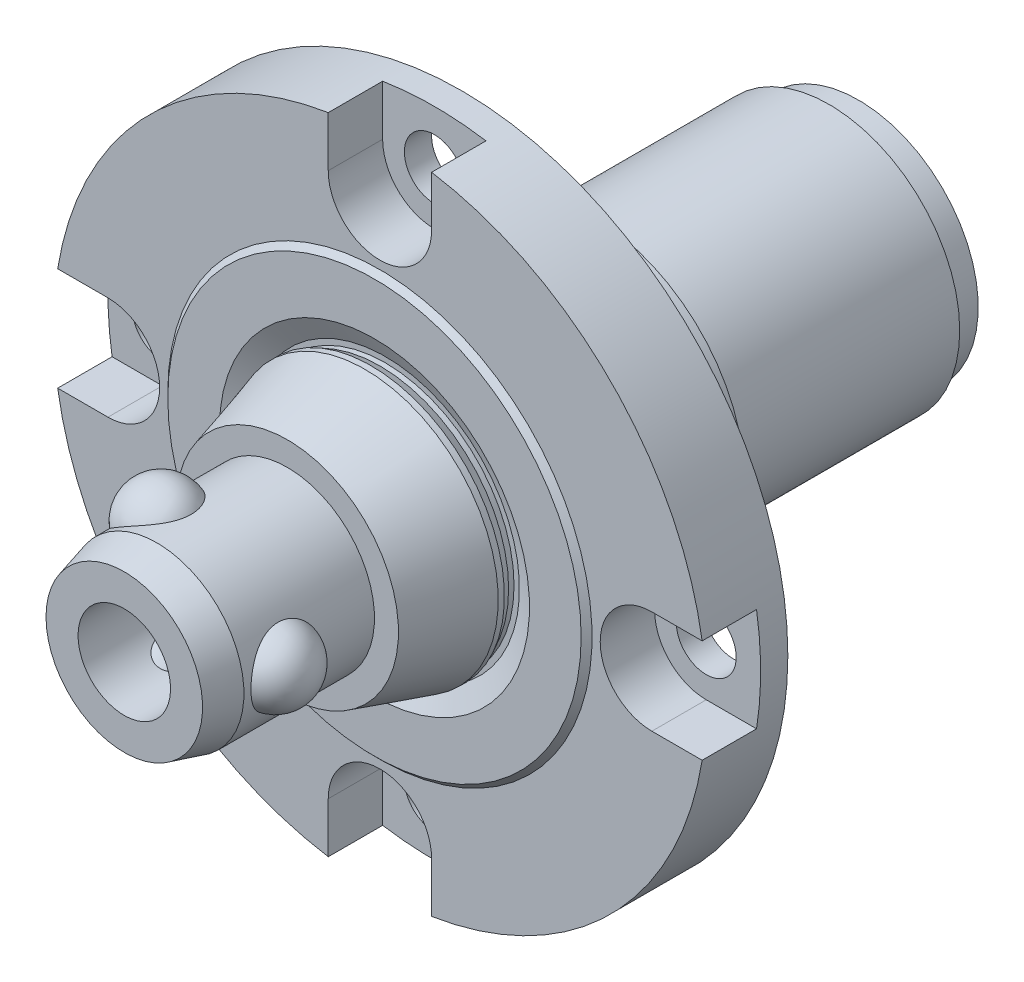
ISO-10303-21;
HEADER;
FILE_DESCRIPTION(('STEP AP214'),'2;1');
FILE_NAME('part.step','',(''),(''),'','','');
FILE_SCHEMA(('AUTOMOTIVE_DESIGN { 1 0 10303 214 1 1 1 1 }'));
ENDSEC;
DATA;
#1=APPLICATION_CONTEXT('core data for automotive mechanical design processes');
#2=APPLICATION_PROTOCOL_DEFINITION('international standard','automotive_design',2000,#1);
#3=PRODUCT_CONTEXT('',#1,'mechanical');
#4=PRODUCT('Part','Part','',(#3));
#5=PRODUCT_RELATED_PRODUCT_CATEGORY('part','',(#4));
#6=PRODUCT_DEFINITION_FORMATION('','',#4);
#7=PRODUCT_DEFINITION_CONTEXT('part definition',#1,'design');
#8=PRODUCT_DEFINITION('design','',#6,#7);
#9=PRODUCT_DEFINITION_SHAPE('','',#8);
#10=(LENGTH_UNIT() NAMED_UNIT(*) SI_UNIT(.MILLI.,.METRE.));
#11=(NAMED_UNIT(*) PLANE_ANGLE_UNIT() SI_UNIT($,.RADIAN.));
#12=(NAMED_UNIT(*) SI_UNIT($,.STERADIAN.) SOLID_ANGLE_UNIT());
#13=UNCERTAINTY_MEASURE_WITH_UNIT(LENGTH_MEASURE(1.E-05),#10,'distance_accuracy_value','');
#14=(GEOMETRIC_REPRESENTATION_CONTEXT(3) GLOBAL_UNCERTAINTY_ASSIGNED_CONTEXT((#13)) GLOBAL_UNIT_ASSIGNED_CONTEXT((#10,
#11,#12)) REPRESENTATION_CONTEXT('',''));
#15=CARTESIAN_POINT('',(0.,0.,0.));
#16=DIRECTION('',(0.,0.,1.));
#17=DIRECTION('',(1.,0.,0.));
#18=AXIS2_PLACEMENT_3D('',#15,#16,#17);
#19=CARTESIAN_POINT('',(9.59064794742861,5.3869724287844,-41.3));
#20=DIRECTION('',(0.,0.,-1.));
#21=DIRECTION('',(-0.489724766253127,0.871877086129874,0.));
#22=AXIS2_PLACEMENT_3D('',#19,#20,#21);
#23=PLANE('',#22);
#24=CARTESIAN_POINT('',(0.,0.,-41.3));
#25=DIRECTION('',(0.,0.,1.));
#26=DIRECTION('',(0.489724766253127,-0.871877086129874,0.));
#27=AXIS2_PLACEMENT_3D('',#24,#25,#26);
#28=CIRCLE('',#27,11.);
#29=CARTESIAN_POINT('',(5.38697242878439,-9.59064794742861,-41.3));
#30=VERTEX_POINT('',#29);
#31=EDGE_CURVE('E391',#30,#30,#28,.T.);
#32=ORIENTED_EDGE('',*,*,#31,.T.);
#33=EDGE_LOOP('',(#32));
#34=FACE_BOUND('',#33,.T.);
#35=CARTESIAN_POINT('',(0.,0.,-41.3));
#36=DIRECTION('',(0.,0.,1.));
#37=DIRECTION('',(0.489724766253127,-0.871877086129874,0.));
#38=AXIS2_PLACEMENT_3D('',#35,#36,#37);
#39=CIRCLE('',#38,12.);
#40=CARTESIAN_POINT('',(5.87669719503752,-10.4625250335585,-41.3));
#41=VERTEX_POINT('',#40);
#42=EDGE_CURVE('E710',#41,#41,#39,.T.);
#43=ORIENTED_EDGE('',*,*,#42,.F.);
#44=EDGE_LOOP('',(#43));
#45=FACE_BOUND('',#44,.T.);
#46=ADVANCED_FACE('F16',(#34,#45),#23,.T.);
#47=CARTESIAN_POINT('',(0.,0.,-19.5));
#48=DIRECTION('',(0.,0.,1.));
#49=DIRECTION('',(0.489724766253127,-0.871877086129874,0.));
#50=AXIS2_PLACEMENT_3D('',#47,#48,#49);
#51=CYLINDRICAL_SURFACE('',#50,12.);
#52=ORIENTED_EDGE('',*,*,#42,.T.);
#53=EDGE_LOOP('',(#52));
#54=FACE_BOUND('',#53,.T.);
#55=CARTESIAN_POINT('',(0.,0.,-19.5));
#56=DIRECTION('',(0.,0.,1.));
#57=DIRECTION('',(0.489724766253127,-0.871877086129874,0.));
#58=AXIS2_PLACEMENT_3D('',#55,#56,#57);
#59=CIRCLE('',#58,12.);
#60=CARTESIAN_POINT('',(5.87669719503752,-10.4625250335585,-19.5));
#61=VERTEX_POINT('',#60);
#62=EDGE_CURVE('E352',#61,#61,#59,.T.);
#63=ORIENTED_EDGE('',*,*,#62,.F.);
#64=EDGE_LOOP('',(#63));
#65=FACE_BOUND('',#64,.T.);
#66=ADVANCED_FACE('F379',(#54,#65),#51,.T.);
#67=CARTESIAN_POINT('',(0.,0.,20.5));
#68=DIRECTION('',(0.,0.,-1.));
#69=DIRECTION('',(-1.,0.,0.));
#70=AXIS2_PLACEMENT_3D('',#67,#68,#69);
#71=CONICAL_SURFACE('',#70,8.,0.261799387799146);
#72=CARTESIAN_POINT('',(0.,0.,23.5));
#73=DIRECTION('',(0.,0.,-1.));
#74=DIRECTION('',(-1.,0.,0.));
#75=AXIS2_PLACEMENT_3D('',#72,#73,#74);
#76=CIRCLE('',#75,7.19615242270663);
#77=CARTESIAN_POINT('',(-7.19615242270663,0.,23.5));
#78=VERTEX_POINT('',#77);
#79=EDGE_CURVE('E238',#78,#78,#76,.F.);
#80=ORIENTED_EDGE('',*,*,#79,.F.);
#81=EDGE_LOOP('',(#80));
#82=FACE_BOUND('',#81,.T.);
#83=CARTESIAN_POINT('',(0.,0.,20.5));
#84=DIRECTION('',(0.,0.,-1.));
#85=DIRECTION('',(-1.,0.,0.));
#86=AXIS2_PLACEMENT_3D('',#83,#84,#85);
#87=CIRCLE('',#86,8.);
#88=CARTESIAN_POINT('',(-8.,0.,20.5));
#89=VERTEX_POINT('',#88);
#90=EDGE_CURVE('E235',#89,#89,#87,.T.);
#91=ORIENTED_EDGE('',*,*,#90,.F.);
#92=EDGE_LOOP('',(#91));
#93=FACE_BOUND('',#92,.T.);
#94=ADVANCED_FACE('F521',(#82,#93),#71,.T.);
#95=CARTESIAN_POINT('',(8.,0.,23.5));
#96=DIRECTION('',(0.,0.,-1.));
#97=DIRECTION('',(-1.,0.,0.));
#98=AXIS2_PLACEMENT_3D('',#95,#96,#97);
#99=PLANE('',#98);
#100=ORIENTED_EDGE('',*,*,#79,.T.);
#101=EDGE_LOOP('',(#100));
#102=FACE_BOUND('',#101,.T.);
#103=CARTESIAN_POINT('',(0.,0.,23.5));
#104=DIRECTION('',(0.,0.,-1.));
#105=DIRECTION('',(-1.,0.,0.));
#106=AXIS2_PLACEMENT_3D('',#103,#104,#105);
#107=CIRCLE('',#106,4.25);
#108=CARTESIAN_POINT('',(-4.25,0.,23.5));
#109=VERTEX_POINT('',#108);
#110=EDGE_CURVE('E226',#109,#109,#107,.T.);
#111=ORIENTED_EDGE('',*,*,#110,.T.);
#112=EDGE_LOOP('',(#111));
#113=FACE_BOUND('',#112,.T.);
#114=ADVANCED_FACE('F402',(#102,#113),#99,.F.);
#115=CARTESIAN_POINT('',(0.,0.,-26.4946490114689));
#116=DIRECTION('',(0.,0.,-1.));
#117=DIRECTION('',(-1.,0.,0.));
#118=AXIS2_PLACEMENT_3D('',#115,#116,#117);
#119=CYLINDRICAL_SURFACE('',#118,4.25);
#120=CARTESIAN_POINT('',(3.9826674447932,-1.48352958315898,16.6266));
#121=CARTESIAN_POINT('',(3.98267005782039,-1.48353053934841,16.7425924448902));
#122=CARTESIAN_POINT('',(3.98556669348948,-1.47581715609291,16.8586391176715));
#123=CARTESIAN_POINT('',(3.99693653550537,-1.44473796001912,17.0885072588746));
#124=CARTESIAN_POINT('',(4.00541761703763,-1.42135004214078,17.2023253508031));
#125=CARTESIAN_POINT('',(4.02727029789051,-1.35820476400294,17.425360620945));
#126=CARTESIAN_POINT('',(4.04066000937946,-1.31838670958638,17.5345590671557));
#127=CARTESIAN_POINT('',(4.07099274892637,-1.22151280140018,17.7445056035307));
#128=CARTESIAN_POINT('',(4.08793103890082,-1.16447988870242,17.8452647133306));
#129=CARTESIAN_POINT('',(4.11885718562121,-1.04887228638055,18.0104625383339));
#130=CARTESIAN_POINT('',(4.13253039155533,-0.994212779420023,18.0777000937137));
#131=CARTESIAN_POINT('',(4.15946905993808,-0.874675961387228,18.2025022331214));
#132=CARTESIAN_POINT('',(4.17273503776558,-0.809812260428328,18.2600794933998));
#133=CARTESIAN_POINT('',(4.19521881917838,-0.682670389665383,18.3536700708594));
#134=CARTESIAN_POINT('',(4.20473863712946,-0.621931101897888,18.3916941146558));
#135=CARTESIAN_POINT('',(4.22158673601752,-0.494778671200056,18.4574068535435));
#136=CARTESIAN_POINT('',(4.22891609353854,-0.428368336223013,18.4851006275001));
#137=CARTESIAN_POINT('',(4.24058787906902,-0.291008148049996,18.5286362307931));
#138=CARTESIAN_POINT('',(4.24491134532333,-0.220032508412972,18.5444028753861));
#139=CARTESIAN_POINT('',(4.24992275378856,-0.0762674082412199,18.5626435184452));
#140=CARTESIAN_POINT('',(4.25061252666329,-0.00347887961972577,18.5651242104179));
#141=CARTESIAN_POINT('',(4.24839676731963,0.133469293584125,18.5570867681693));
#142=CARTESIAN_POINT('',(4.24586745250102,0.197720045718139,18.5479289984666));
#143=CARTESIAN_POINT('',(4.23812228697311,0.323737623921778,18.5194490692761));
#144=CARTESIAN_POINT('',(4.2329064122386,0.385504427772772,18.5001268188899));
#145=CARTESIAN_POINT('',(4.22021062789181,0.506018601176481,18.4519910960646));
#146=CARTESIAN_POINT('',(4.21269800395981,0.564706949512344,18.4230399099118));
#147=CARTESIAN_POINT('',(4.19610470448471,0.6770808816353,18.3570572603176));
#148=CARTESIAN_POINT('',(4.18702323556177,0.730763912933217,18.3200217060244));
#149=CARTESIAN_POINT('',(4.16413359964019,0.853097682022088,18.2229084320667));
#150=CARTESIAN_POINT('',(4.14989416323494,0.919076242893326,18.159556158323));
#151=CARTESIAN_POINT('',(4.12133554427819,1.03968846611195,18.0228356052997));
#152=CARTESIAN_POINT('',(4.10701625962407,1.09429939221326,17.9494477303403));
#153=CARTESIAN_POINT('',(4.07593969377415,1.20557664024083,17.7744920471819));
#154=CARTESIAN_POINT('',(4.05957035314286,1.25880474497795,17.670670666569));
#155=CARTESIAN_POINT('',(4.03082289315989,1.34802035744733,17.455444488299));
#156=CARTESIAN_POINT('',(4.01844699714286,1.38399826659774,17.3440355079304));
#157=CARTESIAN_POINT('',(3.99874858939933,1.43993074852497,17.1152587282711));
#158=CARTESIAN_POINT('',(3.99149680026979,1.45966167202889,16.9978306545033));
#159=CARTESIAN_POINT('',(3.9829585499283,1.48279680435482,16.7611592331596));
#160=CARTESIAN_POINT('',(3.98167416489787,1.48619533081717,16.6419152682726));
#161=CARTESIAN_POINT('',(3.98543681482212,1.47609240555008,16.3874832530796));
#162=CARTESIAN_POINT('',(3.99139427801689,1.46016139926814,16.2523972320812));
#163=CARTESIAN_POINT('',(4.01057890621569,1.40661817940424,15.9870562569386));
#164=CARTESIAN_POINT('',(4.02380366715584,1.36901313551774,15.8567997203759));
#165=CARTESIAN_POINT('',(4.05229410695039,1.28179601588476,15.6335709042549));
#166=CARTESIAN_POINT('',(4.06646812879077,1.23665493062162,15.5387070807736));
#167=CARTESIAN_POINT('',(4.09688411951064,1.13182138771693,15.3577436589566));
#168=CARTESIAN_POINT('',(4.11312300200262,1.07215052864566,15.2716313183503));
#169=CARTESIAN_POINT('',(4.14225140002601,0.952454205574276,15.1292508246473));
#170=CARTESIAN_POINT('',(4.1551042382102,0.895307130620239,15.0705590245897));
#171=CARTESIAN_POINT('',(4.17975636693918,0.772055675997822,14.9631732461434));
#172=CARTESIAN_POINT('',(4.19155686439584,0.705961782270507,14.9144677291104));
#173=CARTESIAN_POINT('',(4.21104821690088,0.577144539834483,14.8365604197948));
#174=CARTESIAN_POINT('',(4.21909527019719,0.515617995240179,14.805475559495));
#175=CARTESIAN_POINT('',(4.23273125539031,0.388056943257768,14.7537028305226));
#176=CARTESIAN_POINT('',(4.2383214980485,0.322024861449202,14.7330094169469));
#177=CARTESIAN_POINT('',(4.24643162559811,0.186860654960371,14.7032065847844));
#178=CARTESIAN_POINT('',(4.24893727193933,0.117715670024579,14.6941508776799));
#179=CARTESIAN_POINT('',(4.25051388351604,-0.0211234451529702,14.688437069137));
#180=CARTESIAN_POINT('',(4.24958552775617,-0.0908174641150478,14.6917765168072));
#181=CARTESIAN_POINT('',(4.24462143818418,-0.222990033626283,14.7098597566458));
#182=CARTESIAN_POINT('',(4.24083455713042,-0.285606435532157,14.7236906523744));
#183=CARTESIAN_POINT('',(4.23084207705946,-0.407715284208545,14.7608784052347));
#184=CARTESIAN_POINT('',(4.22463623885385,-0.467207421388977,14.7842362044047));
#185=CARTESIAN_POINT('',(4.21002127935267,-0.584724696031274,14.8407112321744));
#186=CARTESIAN_POINT('',(4.20151849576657,-0.642532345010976,14.8742534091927));
#187=CARTESIAN_POINT('',(4.1832062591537,-0.752598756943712,14.9491314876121));
#188=CARTESIAN_POINT('',(4.17339608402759,-0.804854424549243,14.9904717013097));
#189=CARTESIAN_POINT('',(4.14873688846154,-0.925057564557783,15.0991329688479));
#190=CARTESIAN_POINT('',(4.13356472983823,-0.989837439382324,15.1698974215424));
#191=CARTESIAN_POINT('',(4.10375801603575,-1.10694915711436,15.3212209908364));
#192=CARTESIAN_POINT('',(4.08912474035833,-1.1592528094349,15.4018016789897));
#193=CARTESIAN_POINT('',(4.05822785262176,-1.26372281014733,15.5917642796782));
#194=CARTESIAN_POINT('',(4.04252711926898,-1.31232890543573,15.7031926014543));
#195=CARTESIAN_POINT('',(4.01605617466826,-1.39123083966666,15.9327377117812));
#196=CARTESIAN_POINT('',(4.00528363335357,-1.42153533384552,16.0508513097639));
#197=CARTESIAN_POINT('',(3.99260444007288,-1.45663848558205,16.2457629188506));
#198=CARTESIAN_POINT('',(3.98888965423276,-1.46673434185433,16.3215425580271));
#199=CARTESIAN_POINT('',(3.98392090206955,-1.48017791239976,16.4737405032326));
#200=CARTESIAN_POINT('',(3.9826657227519,-1.48352895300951,16.5501584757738));
#201=CARTESIAN_POINT('',(3.9826674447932,-1.48352958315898,16.6266));
#202=B_SPLINE_CURVE_WITH_KNOTS('',3,(#120,#121,#122,#123,#124,#125,#126,#127,#128,#129,#130,
#131,#132,#133,#134,#135,#136,#137,#138,#139,#140,#141,#142,#143,#144,#145,#146,#147,#148,#149,
#150,#151,#152,#153,#154,#155,#156,#157,#158,#159,#160,#161,#162,#163,#164,#165,#166,#167,#168,
#169,#170,#171,#172,#173,#174,#175,#176,#177,#178,#179,#180,#181,#182,#183,#184,#185,#186,#187,
#188,#189,#190,#191,#192,#193,#194,#195,#196,#197,#198,#199,#200,#201),.UNSPECIFIED.,.T.,.F.,(4,
2,2,2,2,2,2,2,2,2,2,2,2,2,2,2,2,2,2,2,2,2,2,2,2,2,2,2,2,2,2,2,2,2,2,2,2,2,2,2,4),(0.,
0.347775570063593,0.696042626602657,1.04560789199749,1.39470935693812,1.65694073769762,
1.91882528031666,2.13481629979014,2.35070098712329,2.56793545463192,2.78506046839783,
2.97898982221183,3.17292091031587,3.36975428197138,3.56668748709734,3.84288416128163,
4.1196280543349,4.47121412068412,4.82299559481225,5.17954220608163,5.53621285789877,
5.9427563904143,6.3491655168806,6.66603147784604,6.98242926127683,7.23027005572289,
7.47782284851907,7.68515889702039,7.89238419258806,8.10056249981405,8.30869964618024,
8.50054903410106,8.69241739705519,8.89375978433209,9.09521384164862,9.38500962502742,
9.67545414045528,10.0412954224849,10.4069635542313,10.6362682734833,10.865459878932),.UNSPECIFIED.);
#203=CARTESIAN_POINT('',(3.9826674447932,-1.48352958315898,16.6266));
#204=VERTEX_POINT('',#203);
#205=EDGE_CURVE('E10',#204,#204,#202,.T.);
#206=ORIENTED_EDGE('',*,*,#205,.F.);
#207=EDGE_LOOP('',(#206));
#208=FACE_BOUND('',#207,.T.);
#209=CARTESIAN_POINT('',(-3.27610802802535,-2.70732638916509,16.6266));
#210=CARTESIAN_POINT('',(-3.27611016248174,-2.70732817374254,16.7425924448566));
#211=CARTESIAN_POINT('',(-3.27087849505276,-2.71369342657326,16.8586391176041));
#212=CARTESIAN_POINT('',(-3.24964804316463,-2.73907959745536,17.0885072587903));
#213=CARTESIAN_POINT('',(-3.23363405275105,-2.75811838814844,17.2023253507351));
#214=CARTESIAN_POINT('',(-3.18987497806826,-2.80861600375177,17.4253606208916));
#215=CARTESIAN_POINT('',(-3.16208638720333,-2.84012086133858,17.5345590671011));
#216=CARTESIAN_POINT('',(-3.09335749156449,-2.9148267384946,17.7445056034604));
#217=CARTESIAN_POINT('',(-3.05243468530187,-2.9580121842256,17.8452647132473));
#218=CARTESIAN_POINT('',(-2.96777863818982,-3.04259881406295,18.0104625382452));
#219=CARTESIAN_POINT('',(-2.92727871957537,-3.08176991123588,18.0777000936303));
#220=CARTESIAN_POINT('',(-2.83722613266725,-3.16486789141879,18.2025022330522));
#221=CARTESIAN_POINT('',(-2.78768550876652,-3.20878841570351,18.260079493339));
#222=CARTESIAN_POINT('',(-2.68881930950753,-3.29183087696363,18.3536700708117));
#223=CARTESIAN_POINT('',(-2.64097745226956,-3.33044492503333,18.3916941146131));
#224=CARTESIAN_POINT('',(-2.53928426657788,-3.40861202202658,18.4574068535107));
#225=CARTESIAN_POINT('',(-2.48543590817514,-3.4481645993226,18.4851006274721));
#226=CARTESIAN_POINT('',(-2.37231438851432,-3.52695275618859,18.5286362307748));
#227=CARTESIAN_POINT('',(-2.31300941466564,-3.56618480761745,18.5444028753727));
#228=CARTESIAN_POINT('',(-2.19101088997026,-3.64240736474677,18.5626435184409));
#229=CARTESIAN_POINT('',(-2.12831906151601,-3.67939898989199,18.5651242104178));
#230=CARTESIAN_POINT('',(-2.00861058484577,-3.74595417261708,18.5570867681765));
#231=CARTESIAN_POINT('',(-1.95170314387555,-3.77588909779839,18.5479289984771));
#232=CARTESIAN_POINT('',(-1.83869613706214,-3.83219037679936,18.5194490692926));
#233=CARTESIAN_POINT('',(-1.78259657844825,-3.85855669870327,18.5001268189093));
#234=CARTESIAN_POINT('',(-1.67188035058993,-3.9078189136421,18.4519910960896));
#235=CARTESIAN_POINT('',(-1.61729843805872,-3.93065696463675,18.4230399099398));
#236=CARTESIAN_POINT('',(-1.51168310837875,-3.97247371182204,18.3570572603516));
#237=CARTESIAN_POINT('',(-1.46065150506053,-3.991450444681,18.3200217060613));
#238=CARTESIAN_POINT('',(-1.34326253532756,-4.03279432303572,18.2229084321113));
#239=CARTESIAN_POINT('',(-1.27900370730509,-4.05345188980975,18.1595561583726));
#240=CARTESIAN_POINT('',(-1.16027114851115,-4.08902551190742,18.0228356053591));
#241=CARTESIAN_POINT('',(-1.10581705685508,-4.10393011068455,17.9494477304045));
#242=CARTESIAN_POINT('',(-0.993909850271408,-4.13265563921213,17.7744920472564));
#243=CARTESIAN_POINT('',(-0.939628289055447,-4.14509342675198,17.6706706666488));
#244=CARTESIAN_POINT('',(-0.847991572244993,-4.16480520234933,17.455444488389));
#245=CARTESIAN_POINT('',(-0.810645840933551,-4.17207631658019,17.3440355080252));
#246=CARTESIAN_POINT('',(-0.75235768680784,-4.18298323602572,17.1152587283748));
#247=CARTESIAN_POINT('',(-0.731644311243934,-4.1865684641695,16.9978306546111));
#248=CARTESIAN_POINT('',(-0.707339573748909,-4.19074168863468,16.7611592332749));
#249=CARTESIAN_POINT('',(-0.703754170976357,-4.19132864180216,16.6419152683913));
#250=CARTESIAN_POINT('',(-0.71438488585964,-4.18953572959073,16.3874832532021));
#251=CARTESIAN_POINT('',(-0.731160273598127,-4.18672954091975,16.2523972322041));
#252=CARTESIAN_POINT('',(-0.78712237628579,-4.17657230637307,15.9870562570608));
#253=CARTESIAN_POINT('',(-0.82630168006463,-4.1692227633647,15.856799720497));
#254=CARTESIAN_POINT('',(-0.916079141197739,-4.15028764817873,15.633570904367));
#255=CARTESIAN_POINT('',(-0.96225947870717,-4.13999216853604,15.5387070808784));
#256=CARTESIAN_POINT('',(-1.06825598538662,-4.11391641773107,15.3577436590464));
#257=CARTESIAN_POINT('',(-1.12805190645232,-4.09814427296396,15.2716313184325));
#258=CARTESIAN_POINT('',(-1.2462761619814,-4.0635220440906,15.1292508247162));
#259=CARTESIAN_POINT('',(-1.30219339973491,-4.04607939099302,15.0705590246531));
#260=CARTESIAN_POINT('',(-1.42125835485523,-4.00580303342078,14.9631732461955));
#261=CARTESIAN_POINT('',(-1.48439759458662,-3.98297561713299,14.9144677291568));
#262=CARTESIAN_POINT('',(-1.60570227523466,-3.93544700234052,14.8365604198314));
#263=CARTESIAN_POINT('',(-1.66300935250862,-3.91165268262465,14.8054755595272));
#264=CARTESIAN_POINT('',(-1.78029845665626,-3.85968126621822,14.7537028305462));
#265=CARTESIAN_POINT('',(-1.84027903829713,-3.83150651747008,14.7330094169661));
#266=CARTESIAN_POINT('',(-1.96138973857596,-3.77094799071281,14.7032065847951));
#267=CARTESIAN_POINT('',(-2.02252387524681,-3.73854545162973,14.6941508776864));
#268=CARTESIAN_POINT('',(-2.1435503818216,-3.67049127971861,14.6884370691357));
#269=CARTESIAN_POINT('',(-2.20344299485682,-3.63484029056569,14.6917765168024));
#270=CARTESIAN_POINT('',(-2.31542575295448,-3.56445497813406,14.7098597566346));
#271=CARTESIAN_POINT('',(-2.36775970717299,-3.52986724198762,14.7236906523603));
#272=CARTESIAN_POINT('',(-2.46851283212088,-3.4601590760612,14.7608784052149));
#273=CARTESIAN_POINT('',(-2.5169316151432,-3.42503859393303,14.7842362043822));
#274=CARTESIAN_POINT('',(-2.61139708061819,-3.35362303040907,14.8407112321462));
#275=CARTESIAN_POINT('',(-2.65720858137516,-3.31735557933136,14.8742534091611));
#276=CARTESIAN_POINT('',(-2.74337277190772,-3.24646351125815,14.9491314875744));
#277=CARTESIAN_POINT('',(-2.783722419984,-3.21183981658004,14.9904717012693));
#278=CARTESIAN_POINT('',(-2.87549179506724,-3.13038275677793,15.0991329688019));
#279=CARTESIAN_POINT('',(-2.92400673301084,-3.08485334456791,15.1698974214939));
#280=CARTESIAN_POINT('',(-3.01052509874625,-3.00048411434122,15.3212209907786));
#281=CARTESIAN_POINT('',(-3.04850475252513,-2.96165949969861,15.4018016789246));
#282=CARTESIAN_POINT('',(-3.12352998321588,-2.88266700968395,15.5917642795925));
#283=CARTESIAN_POINT('',(-3.15777372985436,-2.8447667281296,15.7031926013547));
#284=CARTESIAN_POINT('',(-3.21286933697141,-2.78239125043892,15.9327377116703));
#285=CARTESIAN_POINT('',(-3.23372752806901,-2.75790970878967,16.0508513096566));
#286=CARTESIAN_POINT('',(-3.25778815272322,-2.72937762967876,16.2457629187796));
#287=CARTESIAN_POINT('',(-3.26467402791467,-2.72111260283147,16.3215425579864));
#288=CARTESIAN_POINT('',(-3.27383212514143,-2.71008775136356,16.4737405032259));
#289=CARTESIAN_POINT('',(-3.27610662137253,-2.70732521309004,16.5501584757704));
#290=CARTESIAN_POINT('',(-3.27610802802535,-2.70732638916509,16.6266));
#291=B_SPLINE_CURVE_WITH_KNOTS('',3,(#209,#210,#211,#212,#213,#214,#215,#216,#217,#218,#219,
#220,#221,#222,#223,#224,#225,#226,#227,#228,#229,#230,#231,#232,#233,#234,#235,#236,#237,#238,
#239,#240,#241,#242,#243,#244,#245,#246,#247,#248,#249,#250,#251,#252,#253,#254,#255,#256,#257,
#258,#259,#260,#261,#262,#263,#264,#265,#266,#267,#268,#269,#270,#271,#272,#273,#274,#275,#276,
#277,#278,#279,#280,#281,#282,#283,#284,#285,#286,#287,#288,#289,#290),.UNSPECIFIED.,.T.,.F.,(4,
2,2,2,2,2,2,2,2,2,2,2,2,2,2,2,2,2,2,2,2,2,2,2,2,2,2,2,2,2,2,2,2,2,2,2,2,2,2,2,4),(0.,
0.347775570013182,0.696042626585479,1.04560789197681,1.39470935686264,1.65694073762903,
1.91882528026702,2.13481629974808,2.35070098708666,2.56793545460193,2.78506046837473,
2.97898982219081,3.17292091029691,3.36975428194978,3.56668748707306,3.8428841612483,
4.11962805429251,4.47121412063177,4.82299559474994,5.17954220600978,5.53621285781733,
5.9427563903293,6.3491655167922,6.66603147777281,6.98242926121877,7.23027005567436,
7.47782284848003,7.6851588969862,7.89238419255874,8.10056249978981,8.30869964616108,
8.50054903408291,8.69241739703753,8.89375978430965,9.09521384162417,9.38500962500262,
9.67545414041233,10.0412954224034,10.4069635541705,10.6362682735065,10.8654598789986),.UNSPECIFIED.);
#292=CARTESIAN_POINT('',(-3.27610802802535,-2.70732638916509,16.6266));
#293=VERTEX_POINT('',#292);
#294=EDGE_CURVE('E30',#293,#293,#291,.T.);
#295=ORIENTED_EDGE('',*,*,#294,.F.);
#296=EDGE_LOOP('',(#295));
#297=FACE_BOUND('',#296,.T.);
#298=CARTESIAN_POINT('',(-3.27610802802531,2.70732638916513,16.6266));
#299=CARTESIAN_POINT('',(-3.27611016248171,2.70732817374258,16.5106075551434));
#300=CARTESIAN_POINT('',(-3.27087849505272,2.71369342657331,16.3945608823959));
#301=CARTESIAN_POINT('',(-3.24964804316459,2.73907959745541,16.1646927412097));
#302=CARTESIAN_POINT('',(-3.23363405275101,2.75811838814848,16.0508746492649));
#303=CARTESIAN_POINT('',(-3.18987497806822,2.80861600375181,15.8278393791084));
#304=CARTESIAN_POINT('',(-3.16208638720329,2.84012086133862,15.7186409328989));
#305=CARTESIAN_POINT('',(-3.09335749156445,2.91482673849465,15.5086943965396));
#306=CARTESIAN_POINT('',(-3.05243468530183,2.95801218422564,15.4079352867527));
#307=CARTESIAN_POINT('',(-2.96777863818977,3.042598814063,15.2427374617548));
#308=CARTESIAN_POINT('',(-2.92727871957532,3.08176991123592,15.1754999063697));
#309=CARTESIAN_POINT('',(-2.8372261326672,3.16486789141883,15.0506977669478));
#310=CARTESIAN_POINT('',(-2.78768550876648,3.20878841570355,14.993120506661));
#311=CARTESIAN_POINT('',(-2.68881930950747,3.29183087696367,14.8995299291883));
#312=CARTESIAN_POINT('',(-2.6409774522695,3.33044492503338,14.8615058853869));
#313=CARTESIAN_POINT('',(-2.53928426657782,3.40861202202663,14.7957931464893));
#314=CARTESIAN_POINT('',(-2.48543590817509,3.44816459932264,14.7680993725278));
#315=CARTESIAN_POINT('',(-2.37231438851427,3.52695275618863,14.7245637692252));
#316=CARTESIAN_POINT('',(-2.31300941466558,3.56618480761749,14.7087971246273));
#317=CARTESIAN_POINT('',(-2.1910108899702,3.64240736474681,14.6905564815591));
#318=CARTESIAN_POINT('',(-2.12831906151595,3.67939898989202,14.6880757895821));
#319=CARTESIAN_POINT('',(-2.00861058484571,3.74595417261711,14.6961132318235));
#320=CARTESIAN_POINT('',(-1.95170314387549,3.77588909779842,14.7052710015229));
#321=CARTESIAN_POINT('',(-1.83869613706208,3.83219037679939,14.7337509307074));
#322=CARTESIAN_POINT('',(-1.78259657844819,3.85855669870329,14.7530731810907));
#323=CARTESIAN_POINT('',(-1.67188035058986,3.90781891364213,14.8012089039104));
#324=CARTESIAN_POINT('',(-1.61729843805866,3.93065696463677,14.8301600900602));
#325=CARTESIAN_POINT('',(-1.51168310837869,3.97247371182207,14.8961427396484));
#326=CARTESIAN_POINT('',(-1.46065150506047,3.99145044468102,14.9331782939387));
#327=CARTESIAN_POINT('',(-1.3432625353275,4.03279432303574,15.0302915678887));
#328=CARTESIAN_POINT('',(-1.27900370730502,4.05345188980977,15.0936438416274));
#329=CARTESIAN_POINT('',(-1.16027114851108,4.08902551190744,15.2303643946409));
#330=CARTESIAN_POINT('',(-1.10581705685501,4.10393011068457,15.3037522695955));
#331=CARTESIAN_POINT('',(-0.993909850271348,4.13265563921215,15.4787079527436));
#332=CARTESIAN_POINT('',(-0.939628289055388,4.145093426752,15.5825293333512));
#333=CARTESIAN_POINT('',(-0.847991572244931,4.16480520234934,15.797755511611));
#334=CARTESIAN_POINT('',(-0.810645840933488,4.1720763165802,15.9091644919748));
#335=CARTESIAN_POINT('',(-0.752357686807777,4.18298323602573,16.1379412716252));
#336=CARTESIAN_POINT('',(-0.731644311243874,4.18656846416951,16.2553693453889));
#337=CARTESIAN_POINT('',(-0.70733957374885,4.19074168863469,16.4920407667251));
#338=CARTESIAN_POINT('',(-0.703754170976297,4.19132864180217,16.6112847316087));
#339=CARTESIAN_POINT('',(-0.71438488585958,4.18953572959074,16.8657167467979));
#340=CARTESIAN_POINT('',(-0.731160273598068,4.18672954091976,17.0008027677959));
#341=CARTESIAN_POINT('',(-0.787122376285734,4.17657230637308,17.2661437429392));
#342=CARTESIAN_POINT('',(-0.826301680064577,4.16922276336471,17.396400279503));
#343=CARTESIAN_POINT('',(-0.916079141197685,4.15028764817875,17.619629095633));
#344=CARTESIAN_POINT('',(-0.962259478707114,4.13999216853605,17.7144929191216));
#345=CARTESIAN_POINT('',(-1.06825598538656,4.11391641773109,17.8954563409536));
#346=CARTESIAN_POINT('',(-1.12805190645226,4.09814427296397,17.9815686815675));
#347=CARTESIAN_POINT('',(-1.24627616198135,4.06352204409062,18.1239491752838));
#348=CARTESIAN_POINT('',(-1.30219339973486,4.04607939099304,18.1826409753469));
#349=CARTESIAN_POINT('',(-1.42125835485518,4.0058030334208,18.2900267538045));
#350=CARTESIAN_POINT('',(-1.48439759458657,3.98297561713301,18.3387322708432));
#351=CARTESIAN_POINT('',(-1.60570227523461,3.93544700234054,18.4166395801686));
#352=CARTESIAN_POINT('',(-1.66300935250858,3.91165268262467,18.4477244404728));
#353=CARTESIAN_POINT('',(-1.78029845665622,3.85968126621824,18.4994971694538));
#354=CARTESIAN_POINT('',(-1.84027903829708,3.8315065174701,18.5201905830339));
#355=CARTESIAN_POINT('',(-1.96138973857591,3.77094799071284,18.5499934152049));
#356=CARTESIAN_POINT('',(-2.02252387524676,3.73854545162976,18.5590491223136));
#357=CARTESIAN_POINT('',(-2.14355038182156,3.67049127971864,18.5647629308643));
#358=CARTESIAN_POINT('',(-2.20344299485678,3.63484029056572,18.5614234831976));
#359=CARTESIAN_POINT('',(-2.31542575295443,3.56445497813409,18.5433402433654));
#360=CARTESIAN_POINT('',(-2.36775970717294,3.52986724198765,18.5295093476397));
#361=CARTESIAN_POINT('',(-2.46851283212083,3.46015907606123,18.4923215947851));
#362=CARTESIAN_POINT('',(-2.51693161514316,3.42503859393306,18.4689637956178));
#363=CARTESIAN_POINT('',(-2.61139708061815,3.35362303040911,18.4124887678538));
#364=CARTESIAN_POINT('',(-2.65720858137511,3.3173555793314,18.3789465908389));
#365=CARTESIAN_POINT('',(-2.74337277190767,3.24646351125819,18.3040685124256));
#366=CARTESIAN_POINT('',(-2.78372241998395,3.21183981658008,18.2627282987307));
#367=CARTESIAN_POINT('',(-2.8754917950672,3.13038275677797,18.1540670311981));
#368=CARTESIAN_POINT('',(-2.92400673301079,3.08485334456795,18.0833025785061));
#369=CARTESIAN_POINT('',(-3.01052509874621,3.00048411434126,17.9319790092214));
#370=CARTESIAN_POINT('',(-3.04850475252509,2.96165949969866,17.8513983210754));
#371=CARTESIAN_POINT('',(-3.12352998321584,2.88266700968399,17.6614357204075));
#372=CARTESIAN_POINT('',(-3.15777372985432,2.84476672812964,17.5500073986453));
#373=CARTESIAN_POINT('',(-3.21286933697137,2.78239125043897,17.3204622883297));
#374=CARTESIAN_POINT('',(-3.23372752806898,2.75790970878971,17.2023486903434));
#375=CARTESIAN_POINT('',(-3.25778815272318,2.72937762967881,17.0074370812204));
#376=CARTESIAN_POINT('',(-3.26467402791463,2.72111260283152,16.9316574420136));
#377=CARTESIAN_POINT('',(-3.2738321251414,2.71008775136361,16.7794594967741));
#378=CARTESIAN_POINT('',(-3.27610662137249,2.70732521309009,16.7030415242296));
#379=CARTESIAN_POINT('',(-3.27610802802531,2.70732638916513,16.6266));
#380=B_SPLINE_CURVE_WITH_KNOTS('',3,(#298,#299,#300,#301,#302,#303,#304,#305,#306,#307,#308,
#309,#310,#311,#312,#313,#314,#315,#316,#317,#318,#319,#320,#321,#322,#323,#324,#325,#326,#327,
#328,#329,#330,#331,#332,#333,#334,#335,#336,#337,#338,#339,#340,#341,#342,#343,#344,#345,#346,
#347,#348,#349,#350,#351,#352,#353,#354,#355,#356,#357,#358,#359,#360,#361,#362,#363,#364,#365,
#366,#367,#368,#369,#370,#371,#372,#373,#374,#375,#376,#377,#378,#379),.UNSPECIFIED.,.T.,.F.,(4,
2,2,2,2,2,2,2,2,2,2,2,2,2,2,2,2,2,2,2,2,2,2,2,2,2,2,2,2,2,2,2,2,2,2,2,2,2,2,2,4),(0.,
0.347775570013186,0.696042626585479,1.04560789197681,1.39470935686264,1.65694073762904,
1.91882528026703,2.1348162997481,2.35070098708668,2.56793545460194,2.78506046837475,
2.97898982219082,3.17292091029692,3.3697542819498,3.56668748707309,3.84288416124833,
4.11962805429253,4.47121412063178,4.82299559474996,5.17954220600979,5.53621285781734,
5.94275639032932,6.34916551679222,6.66603147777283,6.98242926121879,7.23027005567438,
7.47782284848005,7.68515889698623,7.89238419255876,8.10056249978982,8.3086996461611,
8.50054903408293,8.69241739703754,8.89375978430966,9.09521384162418,9.38500962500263,
9.67545414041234,10.0412954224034,10.4069635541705,10.6362682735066,10.8654598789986),.UNSPECIFIED.);
#381=CARTESIAN_POINT('',(-3.27610802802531,2.70732638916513,16.6266));
#382=VERTEX_POINT('',#381);
#383=EDGE_CURVE('E383',#382,#382,#380,.T.);
#384=ORIENTED_EDGE('',*,*,#383,.F.);
#385=EDGE_LOOP('',(#384));
#386=FACE_BOUND('',#385,.T.);
#387=ORIENTED_EDGE('',*,*,#110,.F.);
#388=EDGE_LOOP('',(#387));
#389=FACE_BOUND('',#388,.T.);
#390=CARTESIAN_POINT('',(0.,0.,5.5));
#391=DIRECTION('',(0.,0.,1.));
#392=DIRECTION('',(1.,0.,0.));
#393=AXIS2_PLACEMENT_3D('',#390,#391,#392);
#394=CIRCLE('',#393,4.25);
#395=CARTESIAN_POINT('',(4.25,0.,5.5));
#396=VERTEX_POINT('',#395);
#397=EDGE_CURVE('E214',#396,#396,#394,.T.);
#398=ORIENTED_EDGE('',*,*,#397,.F.);
#399=EDGE_LOOP('',(#398));
#400=FACE_BOUND('',#399,.T.);
#401=ADVANCED_FACE('F396',(#208,#297,#386,#389,#400),#119,.F.);
#402=CARTESIAN_POINT('',(-4.25,0.,5.5));
#403=DIRECTION('',(0.,0.,-1.));
#404=DIRECTION('',(-1.,0.,0.));
#405=AXIS2_PLACEMENT_3D('',#402,#403,#404);
#406=PLANE('',#405);
#407=ORIENTED_EDGE('',*,*,#397,.T.);
#408=EDGE_LOOP('',(#407));
#409=FACE_BOUND('',#408,.T.);
#410=CARTESIAN_POINT('',(0.,0.,5.5));
#411=DIRECTION('',(0.,0.,1.));
#412=DIRECTION('',(1.,0.,0.));
#413=AXIS2_PLACEMENT_3D('',#410,#411,#412);
#414=CIRCLE('',#413,6.25);
#415=CARTESIAN_POINT('',(6.25,0.,5.5));
#416=VERTEX_POINT('',#415);
#417=EDGE_CURVE('E211',#416,#416,#414,.T.);
#418=ORIENTED_EDGE('',*,*,#417,.F.);
#419=EDGE_LOOP('',(#418));
#420=FACE_BOUND('',#419,.T.);
#421=ADVANCED_FACE('F401',(#409,#420),#406,.T.);
#422=CARTESIAN_POINT('',(0.,0.,7.6884022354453));
#423=DIRECTION('',(0.,0.,1.));
#424=DIRECTION('',(1.,0.,0.));
#425=AXIS2_PLACEMENT_3D('',#422,#423,#424);
#426=CYLINDRICAL_SURFACE('',#425,6.25);
#427=ORIENTED_EDGE('',*,*,#417,.T.);
#428=EDGE_LOOP('',(#427));
#429=FACE_BOUND('',#428,.T.);
#430=CARTESIAN_POINT('',(0.,0.,-8.5));
#431=DIRECTION('',(0.,0.,1.));
#432=DIRECTION('',(1.,0.,0.));
#433=AXIS2_PLACEMENT_3D('',#430,#431,#432);
#434=CIRCLE('',#433,6.25);
#435=CARTESIAN_POINT('',(6.25,0.,-8.5));
#436=VERTEX_POINT('',#435);
#437=EDGE_CURVE('E208',#436,#436,#434,.T.);
#438=ORIENTED_EDGE('',*,*,#437,.F.);
#439=EDGE_LOOP('',(#438));
#440=FACE_BOUND('',#439,.T.);
#441=ADVANCED_FACE('F505',(#429,#440),#426,.F.);
#442=CARTESIAN_POINT('',(7.605,0.,-8.5));
#443=DIRECTION('',(0.,0.,-1.));
#444=DIRECTION('',(-1.,0.,0.));
#445=AXIS2_PLACEMENT_3D('',#442,#443,#444);
#446=PLANE('',#445);
#447=ORIENTED_EDGE('',*,*,#437,.T.);
#448=EDGE_LOOP('',(#447));
#449=FACE_BOUND('',#448,.T.);
#450=CARTESIAN_POINT('',(0.,0.,-8.5));
#451=DIRECTION('',(0.,0.,1.));
#452=DIRECTION('',(1.,0.,0.));
#453=AXIS2_PLACEMENT_3D('',#450,#451,#452);
#454=CIRCLE('',#453,7.6);
#455=CARTESIAN_POINT('',(7.6,0.,-8.5));
#456=VERTEX_POINT('',#455);
#457=EDGE_CURVE('E217',#456,#456,#454,.T.);
#458=ORIENTED_EDGE('',*,*,#457,.F.);
#459=EDGE_LOOP('',(#458));
#460=FACE_BOUND('',#459,.T.);
#461=ADVANCED_FACE('F405',(#449,#460),#446,.T.);
#462=CARTESIAN_POINT('',(0.,0.,0.5));
#463=DIRECTION('',(0.,0.,1.));
#464=DIRECTION('',(1.,0.,0.));
#465=AXIS2_PLACEMENT_3D('',#462,#463,#464);
#466=CYLINDRICAL_SURFACE('',#465,7.6);
#467=CARTESIAN_POINT('',(0.,0.,-16.));
#468=DIRECTION('',(0.,0.,1.));
#469=DIRECTION('',(1.,0.,0.));
#470=AXIS2_PLACEMENT_3D('',#467,#468,#469);
#471=CIRCLE('',#470,7.6);
#472=CARTESIAN_POINT('',(7.6,0.,-16.));
#473=VERTEX_POINT('',#472);
#474=EDGE_CURVE('E220',#473,#473,#471,.T.);
#475=ORIENTED_EDGE('',*,*,#474,.F.);
#476=EDGE_LOOP('',(#475));
#477=FACE_BOUND('',#476,.T.);
#478=ORIENTED_EDGE('',*,*,#457,.T.);
#479=EDGE_LOOP('',(#478));
#480=FACE_BOUND('',#479,.T.);
#481=ADVANCED_FACE('F511',(#477,#480),#466,.F.);
#482=CARTESIAN_POINT('',(-7.605,0.,-16.));
#483=DIRECTION('',(0.,0.,1.));
#484=DIRECTION('',(1.,0.,0.));
#485=AXIS2_PLACEMENT_3D('',#482,#483,#484);
#486=PLANE('',#485);
#487=CARTESIAN_POINT('',(0.,0.,-16.));
#488=DIRECTION('',(0.,0.,1.));
#489=DIRECTION('',(1.,0.,0.));
#490=AXIS2_PLACEMENT_3D('',#487,#488,#489);
#491=CIRCLE('',#490,7.605);
#492=CARTESIAN_POINT('',(7.605,0.,-16.));
#493=VERTEX_POINT('',#492);
#494=EDGE_CURVE('E223',#493,#493,#491,.T.);
#495=ORIENTED_EDGE('',*,*,#494,.F.);
#496=EDGE_LOOP('',(#495));
#497=FACE_BOUND('',#496,.T.);
#498=ORIENTED_EDGE('',*,*,#474,.T.);
#499=EDGE_LOOP('',(#498));
#500=FACE_BOUND('',#499,.T.);
#501=ADVANCED_FACE('F406',(#497,#500),#486,.F.);
#502=CARTESIAN_POINT('',(0.,0.,-26.4946490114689));
#503=DIRECTION('',(0.,0.,-1.));
#504=DIRECTION('',(-1.,0.,0.));
#505=AXIS2_PLACEMENT_3D('',#502,#503,#504);
#506=CYLINDRICAL_SURFACE('',#505,7.605);
#507=ORIENTED_EDGE('',*,*,#494,.T.);
#508=EDGE_LOOP('',(#507));
#509=FACE_BOUND('',#508,.T.);
#510=CARTESIAN_POINT('',(0.,0.,-42.2511473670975));
#511=DIRECTION('',(0.,0.,1.));
#512=DIRECTION('',(1.,0.,0.));
#513=AXIS2_PLACEMENT_3D('',#510,#511,#512);
#514=CIRCLE('',#513,7.605);
#515=CARTESIAN_POINT('',(7.605,0.,-42.2511473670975));
#516=VERTEX_POINT('',#515);
#517=EDGE_CURVE('E353',#516,#516,#514,.T.);
#518=ORIENTED_EDGE('',*,*,#517,.F.);
#519=EDGE_LOOP('',(#518));
#520=FACE_BOUND('',#519,.T.);
#521=ADVANCED_FACE('F519',(#509,#520),#506,.F.);
#522=CARTESIAN_POINT('',(0.,0.,-42.4330127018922));
#523=DIRECTION('',(0.,0.,1.));
#524=DIRECTION('',(0.,-1.,0.));
#525=AXIS2_PLACEMENT_3D('',#522,#523,#524);
#526=CONICAL_SURFACE('',#525,7.5,0.5235987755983);
#527=ORIENTED_EDGE('',*,*,#517,.T.);
#528=EDGE_LOOP('',(#527));
#529=FACE_BOUND('',#528,.T.);
#530=CARTESIAN_POINT('',(0.,0.,-42.4330127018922));
#531=DIRECTION('',(0.,0.,-1.));
#532=DIRECTION('',(0.,1.,0.));
#533=AXIS2_PLACEMENT_3D('',#530,#531,#532);
#534=CIRCLE('',#533,7.5);
#535=CARTESIAN_POINT('',(0.,7.5,-42.4330127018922));
#536=VERTEX_POINT('',#535);
#537=EDGE_CURVE('E346',#536,#536,#534,.T.);
#538=ORIENTED_EDGE('',*,*,#537,.T.);
#539=EDGE_LOOP('',(#538));
#540=FACE_BOUND('',#539,.T.);
#541=ADVANCED_FACE('F632',(#529,#540),#526,.F.);
#542=CARTESIAN_POINT('',(0.,0.,-44.2076775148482));
#543=DIRECTION('',(0.,0.,-1.));
#544=DIRECTION('',(0.,1.,0.));
#545=AXIS2_PLACEMENT_3D('',#542,#543,#544);
#546=CYLINDRICAL_SURFACE('',#545,7.5);
#547=ORIENTED_EDGE('',*,*,#537,.F.);
#548=EDGE_LOOP('',(#547));
#549=FACE_BOUND('',#548,.T.);
#550=CARTESIAN_POINT('',(0.,0.,-43.5));
#551=DIRECTION('',(0.,0.,-1.));
#552=DIRECTION('',(0.,1.,0.));
#553=AXIS2_PLACEMENT_3D('',#550,#551,#552);
#554=CIRCLE('',#553,7.5);
#555=CARTESIAN_POINT('',(0.,7.5,-43.5));
#556=VERTEX_POINT('',#555);
#557=EDGE_CURVE('E644',#556,#556,#554,.T.);
#558=ORIENTED_EDGE('',*,*,#557,.T.);
#559=EDGE_LOOP('',(#558));
#560=FACE_BOUND('',#559,.T.);
#561=ADVANCED_FACE('F447',(#549,#560),#546,.F.);
#562=CARTESIAN_POINT('',(7.5,0.,-43.5));
#563=DIRECTION('',(0.,0.,1.));
#564=DIRECTION('',(0.,-1.,0.));
#565=AXIS2_PLACEMENT_3D('',#562,#563,#564);
#566=PLANE('',#565);
#567=ORIENTED_EDGE('',*,*,#557,.F.);
#568=EDGE_LOOP('',(#567));
#569=FACE_BOUND('',#568,.T.);
#570=CARTESIAN_POINT('',(0.,0.,-43.5));
#571=DIRECTION('',(0.,0.,1.));
#572=DIRECTION('',(1.,0.,0.));
#573=AXIS2_PLACEMENT_3D('',#570,#571,#572);
#574=CIRCLE('',#573,7.605);
#575=CARTESIAN_POINT('',(7.60499999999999,0.,-43.5));
#576=VERTEX_POINT('',#575);
#577=EDGE_CURVE('E349',#576,#576,#574,.F.);
#578=ORIENTED_EDGE('',*,*,#577,.T.);
#579=EDGE_LOOP('',(#578));
#580=FACE_BOUND('',#579,.T.);
#581=ADVANCED_FACE('F550',(#569,#580),#566,.F.);
#582=CARTESIAN_POINT('',(0.,0.,-44.));
#583=DIRECTION('',(0.,0.,-1.));
#584=DIRECTION('',(-1.,0.,0.));
#585=AXIS2_PLACEMENT_3D('',#582,#583,#584);
#586=CIRCLE('',#585,7.605);
#587=CARTESIAN_POINT('',(-7.605,0.,-44.));
#588=VERTEX_POINT('',#587);
#589=EDGE_CURVE('E229',#588,#588,#586,.T.);
#590=ORIENTED_EDGE('',*,*,#589,.T.);
#591=EDGE_LOOP('',(#590));
#592=FACE_BOUND('',#591,.T.);
#593=ORIENTED_EDGE('',*,*,#577,.F.);
#594=EDGE_LOOP('',(#593));
#595=FACE_BOUND('',#594,.T.);
#596=ADVANCED_FACE('F543',(#592,#595),#506,.F.);
#597=CARTESIAN_POINT('',(11.,0.,-44.));
#598=DIRECTION('',(0.,0.,1.));
#599=DIRECTION('',(1.,0.,0.));
#600=AXIS2_PLACEMENT_3D('',#597,#598,#599);
#601=PLANE('',#600);
#602=CARTESIAN_POINT('',(0.,0.,-44.));
#603=DIRECTION('',(0.,0.,-1.));
#604=DIRECTION('',(-1.,0.,0.));
#605=AXIS2_PLACEMENT_3D('',#602,#603,#604);
#606=CIRCLE('',#605,11.);
#607=CARTESIAN_POINT('',(-11.,0.,-44.));
#608=VERTEX_POINT('',#607);
#609=EDGE_CURVE('E232',#608,#608,#606,.T.);
#610=ORIENTED_EDGE('',*,*,#609,.T.);
#611=EDGE_LOOP('',(#610));
#612=FACE_BOUND('',#611,.T.);
#613=ORIENTED_EDGE('',*,*,#589,.F.);
#614=EDGE_LOOP('',(#613));
#615=FACE_BOUND('',#614,.T.);
#616=ADVANCED_FACE('F533',(#612,#615),#601,.F.);
#617=CARTESIAN_POINT('',(0.,0.,-36.676972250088));
#618=DIRECTION('',(0.,0.,-1.));
#619=DIRECTION('',(-1.,0.,0.));
#620=AXIS2_PLACEMENT_3D('',#617,#618,#619);
#621=CYLINDRICAL_SURFACE('',#620,11.);
#622=ORIENTED_EDGE('',*,*,#31,.F.);
#623=EDGE_LOOP('',(#622));
#624=FACE_BOUND('',#623,.T.);
#625=ORIENTED_EDGE('',*,*,#609,.F.);
#626=EDGE_LOOP('',(#625));
#627=FACE_BOUND('',#626,.T.);
#628=ADVANCED_FACE('F443',(#624,#627),#621,.T.);
#629=CARTESIAN_POINT('',(0.,0.,-36.676972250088));
#630=DIRECTION('',(0.,0.,-1.));
#631=DIRECTION('',(-1.,0.,0.));
#632=AXIS2_PLACEMENT_3D('',#629,#630,#631);
#633=CYLINDRICAL_SURFACE('',#632,8.);
#634=CARTESIAN_POINT('',(7.25813926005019,-3.36443375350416,16.6266));
#635=CARTESIAN_POINT('',(7.25814648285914,-3.36442745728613,16.7973158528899));
#636=CARTESIAN_POINT('',(7.26445023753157,-3.35092041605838,16.968300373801));
#637=CARTESIAN_POINT('',(7.28895697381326,-3.2972626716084,17.3054082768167));
#638=CARTESIAN_POINT('',(7.30718861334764,-3.25704779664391,17.4715189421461));
#639=CARTESIAN_POINT('',(7.35338683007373,-3.15134731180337,17.7935064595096));
#640=CARTESIAN_POINT('',(7.38132507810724,-3.08593518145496,17.9494115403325));
#641=CARTESIAN_POINT('',(7.44390759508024,-2.93174511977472,18.2475915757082));
#642=CARTESIAN_POINT('',(7.47854960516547,-2.84297505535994,18.3898710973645));
#643=CARTESIAN_POINT('',(7.55232920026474,-2.64088249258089,18.6625722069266));
#644=CARTESIAN_POINT('',(7.59158134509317,-2.52681248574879,18.7924081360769));
#645=CARTESIAN_POINT('',(7.66962359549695,-2.27897816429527,19.0318677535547));
#646=CARTESIAN_POINT('',(7.70841354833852,-2.14520752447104,19.1414849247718));
#647=CARTESIAN_POINT('',(7.78390918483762,-1.85329200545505,19.3440646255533));
#648=CARTESIAN_POINT('',(7.82037856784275,-1.69420470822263,19.4357600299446));
#649=CARTESIAN_POINT('',(7.88503315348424,-1.36194362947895,19.5927725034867));
#650=CARTESIAN_POINT('',(7.91321750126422,-1.18876839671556,19.6580868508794));
#651=CARTESIAN_POINT('',(7.95890432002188,-0.830081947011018,19.7620073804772));
#652=CARTESIAN_POINT('',(7.9762238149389,-0.644414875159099,19.8001574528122));
#653=CARTESIAN_POINT('',(7.99770097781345,-0.26867149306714,19.847266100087));
#654=CARTESIAN_POINT('',(8.0018590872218,-0.0785953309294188,19.8562256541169));
#655=CARTESIAN_POINT('',(7.99662040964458,0.299175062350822,19.8448297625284));
#656=CARTESIAN_POINT('',(7.98731655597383,0.486876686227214,19.8246753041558));
#657=CARTESIAN_POINT('',(7.95623934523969,0.855891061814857,19.7557883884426));
#658=CARTESIAN_POINT('',(7.93446578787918,1.03720371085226,19.7070554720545));
#659=CARTESIAN_POINT('',(7.88058281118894,1.38854109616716,19.581847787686));
#660=CARTESIAN_POINT('',(7.84846362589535,1.55855498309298,19.5053467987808));
#661=CARTESIAN_POINT('',(7.77713694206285,1.88246331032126,19.3260080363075));
#662=CARTESIAN_POINT('',(7.73792872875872,2.03635612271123,19.2231676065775));
#663=CARTESIAN_POINT('',(7.65626429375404,2.32470136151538,18.9923876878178));
#664=CARTESIAN_POINT('',(7.61378942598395,2.45902722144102,18.8642964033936));
#665=CARTESIAN_POINT('',(7.53054318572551,2.70325810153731,18.5861094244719));
#666=CARTESIAN_POINT('',(7.48977168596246,2.81316494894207,18.4360153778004));
#667=CARTESIAN_POINT('',(7.41569110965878,3.00294908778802,18.1211820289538));
#668=CARTESIAN_POINT('',(7.38223020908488,3.08346677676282,17.9568657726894));
#669=CARTESIAN_POINT('',(7.32575902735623,3.21534680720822,17.6152498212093));
#670=CARTESIAN_POINT('',(7.30274364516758,3.26672338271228,17.4379565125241));
#671=CARTESIAN_POINT('',(7.27121196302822,3.33629282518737,17.0872227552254));
#672=CARTESIAN_POINT('',(7.26188676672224,3.35634196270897,16.9142224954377));
#673=CARTESIAN_POINT('',(7.25624623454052,3.36852340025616,16.5670500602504));
#674=CARTESIAN_POINT('',(7.25992741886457,3.36066316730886,16.3928782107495));
#675=CARTESIAN_POINT('',(7.27940768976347,3.3182393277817,16.0561001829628));
#676=CARTESIAN_POINT('',(7.29468596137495,3.2848229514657,15.8933168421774));
#677=CARTESIAN_POINT('',(7.33504342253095,3.19368136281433,15.5760031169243));
#678=CARTESIAN_POINT('',(7.3601234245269,3.13595413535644,15.4214734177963));
#679=CARTESIAN_POINT('',(7.41813576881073,2.99617900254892,15.1209310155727));
#680=CARTESIAN_POINT('',(7.45123774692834,2.91359481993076,14.9752013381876));
#681=CARTESIAN_POINT('',(7.52159384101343,2.72682309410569,14.6994463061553));
#682=CARTESIAN_POINT('',(7.55884906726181,2.62262976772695,14.5694251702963));
#683=CARTESIAN_POINT('',(7.6363013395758,2.38810415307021,14.3200603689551));
#684=CARTESIAN_POINT('',(7.67653790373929,2.25655441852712,14.2018731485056));
#685=CARTESIAN_POINT('',(7.75367590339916,1.97528937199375,13.9881923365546));
#686=CARTESIAN_POINT('',(7.7905765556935,1.82556981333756,13.8927040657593));
#687=CARTESIAN_POINT('',(7.85894375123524,1.50497938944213,13.7225210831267));
#688=CARTESIAN_POINT('',(7.89011000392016,1.33347739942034,13.6488916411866));
#689=CARTESIAN_POINT('',(7.94182155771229,0.979516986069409,13.5295021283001));
#690=CARTESIAN_POINT('',(7.96236653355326,0.797058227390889,13.4837429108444));
#691=CARTESIAN_POINT('',(7.99085287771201,0.425558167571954,13.420809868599));
#692=CARTESIAN_POINT('',(7.99874390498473,0.236493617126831,13.4037502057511));
#693=CARTESIAN_POINT('',(8.00097756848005,-0.142086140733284,13.3988935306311));
#694=CARTESIAN_POINT('',(7.99532057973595,-0.331601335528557,13.4110957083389));
#695=CARTESIAN_POINT('',(7.97110261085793,-0.704415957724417,13.464355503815));
#696=CARTESIAN_POINT('',(7.95262564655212,-0.88774775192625,13.5052252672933));
#697=CARTESIAN_POINT('',(7.90467954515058,-1.24435732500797,13.6148690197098));
#698=CARTESIAN_POINT('',(7.87520974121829,-1.41763449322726,13.6836447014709));
#699=CARTESIAN_POINT('',(7.80803905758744,-1.75028409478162,13.8482958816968));
#700=CARTESIAN_POINT('',(7.77029395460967,-1.90957512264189,13.9443178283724));
#701=CARTESIAN_POINT('',(7.69058865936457,-2.20881155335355,14.1614971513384));
#702=CARTESIAN_POINT('',(7.6486284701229,-2.34875697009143,14.2826545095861));
#703=CARTESIAN_POINT('',(7.56507305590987,-2.60536110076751,14.547617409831));
#704=CARTESIAN_POINT('',(7.52347773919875,-2.72202583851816,14.6914170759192));
#705=CARTESIAN_POINT('',(7.44547539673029,-2.92867695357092,14.9984630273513));
#706=CARTESIAN_POINT('',(7.40906982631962,-3.01865585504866,15.1617147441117));
#707=CARTESIAN_POINT('',(7.34729724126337,-3.1659733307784,15.4964163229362));
#708=CARTESIAN_POINT('',(7.32155412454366,-3.22445105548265,15.6672956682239));
#709=CARTESIAN_POINT('',(7.28242304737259,-3.3118973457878,16.0174990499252));
#710=CARTESIAN_POINT('',(7.26899943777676,-3.34095108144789,16.1967971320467));
#711=CARTESIAN_POINT('',(7.2610973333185,-3.35804425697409,16.4186704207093));
#712=CARTESIAN_POINT('',(7.25999006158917,-3.36043852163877,16.4602080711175));
#713=CARTESIAN_POINT('',(7.2585101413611,-3.36363404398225,16.543358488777));
#714=CARTESIAN_POINT('',(7.25813749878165,-3.36443528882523,16.5849712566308));
#715=CARTESIAN_POINT('',(7.25813926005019,-3.36443375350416,16.6266));
#716=B_SPLINE_CURVE_WITH_KNOTS('',3,(#634,#635,#636,#637,#638,#639,#640,#641,#642,#643,#644,
#645,#646,#647,#648,#649,#650,#651,#652,#653,#654,#655,#656,#657,#658,#659,#660,#661,#662,#663,
#664,#665,#666,#667,#668,#669,#670,#671,#672,#673,#674,#675,#676,#677,#678,#679,#680,#681,#682,
#683,#684,#685,#686,#687,#688,#689,#690,#691,#692,#693,#694,#695,#696,#697,#698,#699,#700,#701,
#702,#703,#704,#705,#706,#707,#708,#709,#710,#711,#712,#713,#714,#715),.UNSPECIFIED.,.T.,.F.,(4,
2,2,2,2,2,2,2,2,2,2,2,2,2,2,2,2,2,2,2,2,2,2,2,2,2,2,2,2,2,2,2,2,2,2,2,2,2,2,2,4),(0.,
0.5119778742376,1.02519036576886,1.5369174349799,2.04847237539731,2.57784579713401,
3.10738955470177,3.66641744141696,4.22550298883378,4.79376779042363,5.36201353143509,
5.92635511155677,6.49070575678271,7.05559070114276,7.62053263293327,8.18898039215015,
8.75738560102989,9.31253838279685,9.86741976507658,10.3879735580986,10.9083880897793,
11.4067203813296,11.9050939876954,12.4151014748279,12.925245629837,13.466916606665,
14.0087144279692,14.5737084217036,15.1387197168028,15.7059732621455,16.2732111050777,
16.8367662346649,17.4003555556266,17.9670334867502,18.5337110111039,19.1002417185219,
19.6669309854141,20.2114522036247,20.7543927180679,20.8792365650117,21.0040814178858),.UNSPECIFIED.);
#717=CARTESIAN_POINT('',(7.25813926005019,-3.36443375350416,16.6266));
#718=VERTEX_POINT('',#717);
#719=EDGE_CURVE('E20',#718,#718,#716,.T.);
#720=ORIENTED_EDGE('',*,*,#719,.T.);
#721=EDGE_LOOP('',(#720));
#722=FACE_BOUND('',#721,.T.);
#723=CARTESIAN_POINT('',(-6.54275472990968,-4.60351610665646,16.6266));
#724=CARTESIAN_POINT('',(-6.54275288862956,-4.60352550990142,16.7973158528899));
#725=CARTESIAN_POINT('',(-6.53420732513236,-4.61573824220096,16.968300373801));
#726=CARTESIAN_POINT('',(-6.4999917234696,-4.66379057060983,17.3054082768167));
#727=CARTESIAN_POINT('',(-6.47428043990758,-4.69968707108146,17.4715189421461));
#728=CARTESIAN_POINT('',(-6.40584024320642,-4.79254614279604,17.7935064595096));
#729=CARTESIAN_POINT('',(-6.36316080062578,-4.84944744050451,17.9494115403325));
#730=CARTESIAN_POINT('',(-6.26091954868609,-4.98074052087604,18.2475915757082));
#731=CARTESIAN_POINT('',(-6.20136342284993,-5.05512641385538,18.3898710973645));
#732=CARTESIAN_POINT('',(-6.06323592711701,-5.2200676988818,18.6625722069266));
#733=CARTESIAN_POINT('',(-5.98407447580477,-5.31109605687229,18.7924081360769));
#734=CARTESIAN_POINT('',(-5.80846478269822,-5.50259978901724,19.0318677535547));
#735=CARTESIAN_POINT('',(-5.71201098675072,-5.60307819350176,19.1414849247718));
#736=CARTESIAN_POINT('',(-5.49695254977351,-5.81441709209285,19.3440646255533));
#737=CARTESIAN_POINT('',(-5.37741360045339,-5.92554415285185,19.4357600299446));
#738=CARTESIAN_POINT('',(-5.12199435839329,-6.14766720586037,19.5927725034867));
#739=CARTESIAN_POINT('',(-4.9861123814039,-6.25866318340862,19.6580868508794));
#740=CARTESIAN_POINT('',(-4.69832421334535,-6.47757235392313,19.7620073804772));
#741=CARTESIAN_POINT('',(-4.54619155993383,-6.58540501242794,19.8001574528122));
#742=CARTESIAN_POINT('',(-4.23152682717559,-6.7918764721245,19.847266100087));
#743=CARTESIAN_POINT('',(-4.06899509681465,-6.89051558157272,19.8562256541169));
#744=CARTESIAN_POINT('',(-3.73921700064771,-7.07486395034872,19.8448297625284));
#745=CARTESIAN_POINT('',(-3.57201069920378,-7.16065738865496,19.8246753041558));
#746=CARTESIAN_POINT('',(-3.23689627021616,-7.31825092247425,19.7557883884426));
#747=CARTESIAN_POINT('',(-3.06898813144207,-7.39005079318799,19.7070554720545));
#748=CARTESIAN_POINT('',(-2.73777954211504,-7.51905545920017,19.581847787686));
#749=CARTESIAN_POINT('',(-2.57448360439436,-7.57624637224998,19.5053467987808));
#750=CARTESIAN_POINT('',(-2.25830742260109,-7.67642981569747,19.3260080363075));
#751=CARTESIAN_POINT('',(-2.10542823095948,-7.71942091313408,19.2231676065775));
#752=CARTESIAN_POINT('',(-1.81488171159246,-7.7928700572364,18.9923876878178));
#753=CARTESIAN_POINT('',(-1.67731467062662,-7.82324867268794,18.8642964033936));
#754=CARTESIAN_POINT('',(-1.42418140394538,-7.87327075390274,18.5861094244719));
#755=CARTESIAN_POINT('',(-1.30861353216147,-7.89291502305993,18.4360153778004));
#756=CARTESIAN_POINT('',(-1.10721535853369,-7.92365143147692,18.1211820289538));
#757=CARTESIAN_POINT('',(-1.02075454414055,-7.93493228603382,17.9568657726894));
#758=CARTESIAN_POINT('',(-0.878307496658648,-7.95196682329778,17.6152498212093));
#759=CARTESIAN_POINT('',(-0.822306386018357,-7.95772320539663,17.4379565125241));
#760=CARTESIAN_POINT('',(-0.746291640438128,-7.96520068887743,17.0872227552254));
#761=CARTESIAN_POINT('',(-0.724265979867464,-7.96714940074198,16.9142224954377));
#762=CARTESIAN_POINT('',(-0.710896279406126,-7.96835527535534,16.5670500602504));
#763=CARTESIAN_POINT('',(-0.719544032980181,-7.96761315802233,16.3928782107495));
#764=CARTESIAN_POINT('',(-0.76602429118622,-7.9632716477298,16.0561001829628));
#765=CARTESIAN_POINT('',(-0.802602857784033,-7.95979483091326,15.8933168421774));
#766=CARTESIAN_POINT('',(-0.901712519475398,-7.94917462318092,15.5760031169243));
#767=CARTESIAN_POINT('',(-0.964245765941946,-7.94203092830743,15.4214734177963));
#768=CARTESIAN_POINT('',(-1.11430075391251,-7.92238352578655,15.1209310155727));
#769=CARTESIAN_POINT('',(-1.20237174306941,-7.90975858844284,14.9752013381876));
#770=CARTESIAN_POINT('',(-1.39929884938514,-7.87730289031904,14.6994463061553));
#771=CARTESIAN_POINT('',(-1.50816053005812,-7.8574701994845,14.5694251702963));
#772=CARTESIAN_POINT('',(-1.74999180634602,-7.80728302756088,14.3200603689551));
#773=CARTESIAN_POINT('',(-1.88403550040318,-7.77635404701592,14.2018731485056));
#774=CARTESIAN_POINT('',(-2.16618717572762,-7.70252499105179,13.9881923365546));
#775=CARTESIAN_POINT('',(-2.31429844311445,-7.65962211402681,13.8927040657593));
#776=CARTESIAN_POINT('',(-2.62612149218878,-7.55853463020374,13.7225210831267));
#777=CARTESIAN_POINT('',(-2.7902296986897,-7.49977440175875,13.6488916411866));
#778=CARTESIAN_POINT('',(-3.12262418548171,-7.36757771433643,13.5295021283));
#779=CARTESIAN_POINT('',(-3.29091059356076,-7.29414080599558,13.4837429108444));
#780=CARTESIAN_POINT('',(-3.62688225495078,-7.13306067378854,13.420809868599));
#781=CARTESIAN_POINT('',(-3.7945624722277,-7.04536222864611,13.4037502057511));
#782=CARTESIAN_POINT('',(-4.12353899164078,-6.85800675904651,13.3988935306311));
#783=CARTESIAN_POINT('',(-4.28483547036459,-6.75835006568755,13.4110957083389));
#784=CARTESIAN_POINT('',(-4.59559341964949,-6.55096937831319,13.464355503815));
#785=CARTESIAN_POINT('',(-4.74512492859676,-6.44330196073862,13.5052252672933));
#786=CARTESIAN_POINT('',(-5.02998482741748,-6.22347463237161,13.6148690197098));
#787=CARTESIAN_POINT('',(-5.16531235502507,-6.11131444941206,13.6836447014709));
#788=CARTESIAN_POINT('',(-5.41981001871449,-5.88681813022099,13.8482958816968));
#789=CARTESIAN_POINT('',(-5.53888754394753,-5.77448439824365,13.9443178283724));
#790=CARTESIAN_POINT('',(-5.75818124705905,-5.55583937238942,14.1614971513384));
#791=CARTESIAN_POINT('',(-5.85839743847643,-5.44952807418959,14.2826545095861));
#792=CARTESIAN_POINT('',(-6.03884542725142,-5.24886489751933,14.547617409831));
#793=CARTESIAN_POINT('',(-6.11908239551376,-5.15450992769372,14.6914170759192));
#794=CARTESIAN_POINT('',(-6.25904633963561,-4.98363236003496,14.9984630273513));
#795=CARTESIAN_POINT('',(-6.31876756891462,-4.90711476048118,15.1617147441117));
#796=CARTESIAN_POINT('',(-6.41546195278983,-4.77995939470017,15.4964163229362));
#797=CARTESIAN_POINT('',(-6.45323358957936,-4.7284263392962,15.6672956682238));
#798=CARTESIAN_POINT('',(-6.50939875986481,-4.65081468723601,16.0174990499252));
#799=CARTESIAN_POINT('',(-6.52784822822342,-4.62466263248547,16.1967971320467));
#800=CARTESIAN_POINT('',(-6.53870030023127,-4.60927262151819,16.4186704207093));
#801=CARTESIAN_POINT('',(-6.54022015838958,-4.60711656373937,16.4602080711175));
#802=CARTESIAN_POINT('',(-6.5422476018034,-4.60423715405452,16.543358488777));
#803=CARTESIAN_POINT('',(-6.54275517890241,-4.60351381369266,16.5849712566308));
#804=CARTESIAN_POINT('',(-6.54275472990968,-4.60351610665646,16.6266));
#805=B_SPLINE_CURVE_WITH_KNOTS('',3,(#723,#724,#725,#726,#727,#728,#729,#730,#731,#732,#733,
#734,#735,#736,#737,#738,#739,#740,#741,#742,#743,#744,#745,#746,#747,#748,#749,#750,#751,#752,
#753,#754,#755,#756,#757,#758,#759,#760,#761,#762,#763,#764,#765,#766,#767,#768,#769,#770,#771,
#772,#773,#774,#775,#776,#777,#778,#779,#780,#781,#782,#783,#784,#785,#786,#787,#788,#789,#790,
#791,#792,#793,#794,#795,#796,#797,#798,#799,#800,#801,#802,#803,#804),.UNSPECIFIED.,.T.,.F.,(4,
2,2,2,2,2,2,2,2,2,2,2,2,2,2,2,2,2,2,2,2,2,2,2,2,2,2,2,2,2,2,2,2,2,2,2,2,2,2,2,4),(0.,
0.511977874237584,1.02519036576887,1.53691743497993,2.04847237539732,2.57784579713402,
3.10738955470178,3.66641744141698,4.22550298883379,4.79376779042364,5.3620135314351,
5.92635511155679,6.49070575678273,7.05559070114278,7.62053263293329,8.18898039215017,
8.75738560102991,9.31253838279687,9.8674197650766,10.3879735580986,10.9083880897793,
11.4067203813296,11.9050939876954,12.4151014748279,12.9252456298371,13.466916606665,
14.0087144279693,14.5737084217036,15.1387197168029,15.7059732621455,16.2732111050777,
16.8367662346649,17.4003555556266,17.9670334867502,18.5337110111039,19.100241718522,
19.6669309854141,20.2114522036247,20.7543927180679,20.8792365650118,21.0040814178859),.UNSPECIFIED.);
#806=CARTESIAN_POINT('',(-6.54275472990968,-4.60351610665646,16.6266));
#807=VERTEX_POINT('',#806);
#808=EDGE_CURVE('E361',#807,#807,#805,.T.);
#809=ORIENTED_EDGE('',*,*,#808,.T.);
#810=EDGE_LOOP('',(#809));
#811=FACE_BOUND('',#810,.T.);
#812=CARTESIAN_POINT('',(-6.54275472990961,4.60351610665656,16.6266));
#813=CARTESIAN_POINT('',(-6.54275288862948,4.60352550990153,16.4558841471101));
#814=CARTESIAN_POINT('',(-6.53420732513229,4.61573824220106,16.284899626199));
#815=CARTESIAN_POINT('',(-6.49999172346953,4.66379057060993,15.9477917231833));
#816=CARTESIAN_POINT('',(-6.47428043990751,4.69968707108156,15.7816810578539));
#817=CARTESIAN_POINT('',(-6.40584024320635,4.79254614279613,15.4596935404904));
#818=CARTESIAN_POINT('',(-6.36316080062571,4.8494474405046,15.3037884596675));
#819=CARTESIAN_POINT('',(-6.26091954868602,4.98074052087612,15.0056084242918));
#820=CARTESIAN_POINT('',(-6.20136342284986,5.05512641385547,14.8633289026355));
#821=CARTESIAN_POINT('',(-6.06323592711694,5.22006769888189,14.5906277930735));
#822=CARTESIAN_POINT('',(-5.9840744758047,5.31109605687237,14.4607918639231));
#823=CARTESIAN_POINT('',(-5.80846478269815,5.50259978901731,14.2213322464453));
#824=CARTESIAN_POINT('',(-5.71201098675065,5.60307819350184,14.1117150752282));
#825=CARTESIAN_POINT('',(-5.49695254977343,5.81441709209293,13.9091353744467));
#826=CARTESIAN_POINT('',(-5.37741360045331,5.92554415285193,13.8174399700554));
#827=CARTESIAN_POINT('',(-5.1219943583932,6.14766720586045,13.6604274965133));
#828=CARTESIAN_POINT('',(-4.98611238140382,6.25866318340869,13.5951131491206));
#829=CARTESIAN_POINT('',(-4.69832421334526,6.47757235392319,13.4911926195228));
#830=CARTESIAN_POINT('',(-4.54619155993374,6.58540501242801,13.4530425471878));
#831=CARTESIAN_POINT('',(-4.23152682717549,6.79187647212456,13.405933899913));
#832=CARTESIAN_POINT('',(-4.06899509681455,6.89051558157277,13.3969743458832));
#833=CARTESIAN_POINT('',(-3.73921700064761,7.07486395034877,13.4083702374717));
#834=CARTESIAN_POINT('',(-3.57201069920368,7.16065738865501,13.4285246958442));
#835=CARTESIAN_POINT('',(-3.23689627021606,7.3182509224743,13.4974116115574));
#836=CARTESIAN_POINT('',(-3.06898813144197,7.39005079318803,13.5461445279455));
#837=CARTESIAN_POINT('',(-2.73777954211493,7.5190554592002,13.671352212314));
#838=CARTESIAN_POINT('',(-2.57448360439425,7.57624637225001,13.7478532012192));
#839=CARTESIAN_POINT('',(-2.25830742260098,7.6764298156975,13.9271919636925));
#840=CARTESIAN_POINT('',(-2.10542823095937,7.71942091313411,14.0300323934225));
#841=CARTESIAN_POINT('',(-1.81488171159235,7.79287005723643,14.2608123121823));
#842=CARTESIAN_POINT('',(-1.67731467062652,7.82324867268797,14.3889035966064));
#843=CARTESIAN_POINT('',(-1.42418140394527,7.87327075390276,14.6670905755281));
#844=CARTESIAN_POINT('',(-1.30861353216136,7.89291502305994,14.8171846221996));
#845=CARTESIAN_POINT('',(-1.10721535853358,7.92365143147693,15.1320179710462));
#846=CARTESIAN_POINT('',(-1.02075454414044,7.93493228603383,15.2963342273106));
#847=CARTESIAN_POINT('',(-0.878307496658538,7.95196682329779,15.6379501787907));
#848=CARTESIAN_POINT('',(-0.822306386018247,7.95772320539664,15.8152434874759));
#849=CARTESIAN_POINT('',(-0.746291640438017,7.96520068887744,16.1659772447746));
#850=CARTESIAN_POINT('',(-0.724265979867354,7.96714940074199,16.3389775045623));
#851=CARTESIAN_POINT('',(-0.710896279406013,7.96835527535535,16.6861499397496));
#852=CARTESIAN_POINT('',(-0.719544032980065,7.96761315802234,16.8603217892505));
#853=CARTESIAN_POINT('',(-0.766024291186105,7.96327164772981,17.1970998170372));
#854=CARTESIAN_POINT('',(-0.802602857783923,7.95979483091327,17.3598831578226));
#855=CARTESIAN_POINT('',(-0.901712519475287,7.94917462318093,17.6771968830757));
#856=CARTESIAN_POINT('',(-0.96424576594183,7.94203092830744,17.8317265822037));
#857=CARTESIAN_POINT('',(-1.1143007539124,7.92238352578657,18.1322689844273));
#858=CARTESIAN_POINT('',(-1.2023717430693,7.90975858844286,18.2779986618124));
#859=CARTESIAN_POINT('',(-1.39929884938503,7.87730289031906,18.5537536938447));
#860=CARTESIAN_POINT('',(-1.50816053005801,7.85747019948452,18.6837748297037));
#861=CARTESIAN_POINT('',(-1.7499918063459,7.8072830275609,18.9331396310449));
#862=CARTESIAN_POINT('',(-1.88403550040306,7.77635404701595,19.0513268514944));
#863=CARTESIAN_POINT('',(-2.1661871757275,7.70252499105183,19.2650076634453));
#864=CARTESIAN_POINT('',(-2.31429844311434,7.65962211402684,19.3604959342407));
#865=CARTESIAN_POINT('',(-2.62612149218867,7.55853463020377,19.5306789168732));
#866=CARTESIAN_POINT('',(-2.79022969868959,7.49977440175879,19.6043083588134));
#867=CARTESIAN_POINT('',(-3.1226241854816,7.36757771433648,19.7236978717));
#868=CARTESIAN_POINT('',(-3.29091059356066,7.29414080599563,19.7694570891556));
#869=CARTESIAN_POINT('',(-3.62688225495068,7.1330606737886,19.832390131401));
#870=CARTESIAN_POINT('',(-3.7945624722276,7.04536222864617,19.8494497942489));
#871=CARTESIAN_POINT('',(-4.12353899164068,6.85800675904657,19.8543064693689));
#872=CARTESIAN_POINT('',(-4.28483547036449,6.75835006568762,19.8421042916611));
#873=CARTESIAN_POINT('',(-4.5955934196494,6.55096937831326,19.788844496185));
#874=CARTESIAN_POINT('',(-4.74512492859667,6.4433019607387,19.7479747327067));
#875=CARTESIAN_POINT('',(-5.02998482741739,6.22347463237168,19.6383309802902));
#876=CARTESIAN_POINT('',(-5.16531235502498,6.11131444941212,19.5695552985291));
#877=CARTESIAN_POINT('',(-5.4198100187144,5.88681813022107,19.4049041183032));
#878=CARTESIAN_POINT('',(-5.53888754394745,5.77448439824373,19.3088821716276));
#879=CARTESIAN_POINT('',(-5.75818124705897,5.55583937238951,19.0917028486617));
#880=CARTESIAN_POINT('',(-5.85839743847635,5.44952807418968,18.9705454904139));
#881=CARTESIAN_POINT('',(-6.03884542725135,5.24886489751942,18.705582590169));
#882=CARTESIAN_POINT('',(-6.11908239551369,5.15450992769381,18.5617829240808));
#883=CARTESIAN_POINT('',(-6.25904633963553,4.98363236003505,18.2547369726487));
#884=CARTESIAN_POINT('',(-6.31876756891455,4.90711476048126,18.0914852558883));
#885=CARTESIAN_POINT('',(-6.41546195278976,4.77995939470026,17.7567836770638));
#886=CARTESIAN_POINT('',(-6.45323358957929,4.72842633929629,17.5859043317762));
#887=CARTESIAN_POINT('',(-6.50939875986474,4.65081468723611,17.2357009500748));
#888=CARTESIAN_POINT('',(-6.52784822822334,4.62466263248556,17.0564028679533));
#889=CARTESIAN_POINT('',(-6.5387003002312,4.60927262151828,16.8345295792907));
#890=CARTESIAN_POINT('',(-6.54022015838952,4.60711656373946,16.7929919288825));
#891=CARTESIAN_POINT('',(-6.54224760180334,4.60423715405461,16.709841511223));
#892=CARTESIAN_POINT('',(-6.54275517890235,4.60351381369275,16.6682287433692));
#893=CARTESIAN_POINT('',(-6.54275472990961,4.60351610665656,16.6266));
#894=B_SPLINE_CURVE_WITH_KNOTS('',3,(#812,#813,#814,#815,#816,#817,#818,#819,#820,#821,#822,
#823,#824,#825,#826,#827,#828,#829,#830,#831,#832,#833,#834,#835,#836,#837,#838,#839,#840,#841,
#842,#843,#844,#845,#846,#847,#848,#849,#850,#851,#852,#853,#854,#855,#856,#857,#858,#859,#860,
#861,#862,#863,#864,#865,#866,#867,#868,#869,#870,#871,#872,#873,#874,#875,#876,#877,#878,#879,
#880,#881,#882,#883,#884,#885,#886,#887,#888,#889,#890,#891,#892,#893),.UNSPECIFIED.,.T.,.F.,(4,
2,2,2,2,2,2,2,2,2,2,2,2,2,2,2,2,2,2,2,2,2,2,2,2,2,2,2,2,2,2,2,2,2,2,2,2,2,2,2,4),(0.,
0.511977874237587,1.02519036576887,1.53691743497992,2.0484723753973,2.577845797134,
3.10738955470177,3.66641744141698,4.2255029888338,4.79376779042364,5.3620135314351,
5.92635511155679,6.49070575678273,7.05559070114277,7.62053263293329,8.18898039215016,
8.7573856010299,9.31253838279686,9.86741976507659,10.3879735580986,10.9083880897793,
11.4067203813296,11.9050939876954,12.4151014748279,12.925245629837,13.466916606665,
14.0087144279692,14.5737084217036,15.1387197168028,15.7059732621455,16.2732111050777,
16.8367662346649,17.4003555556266,17.9670334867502,18.5337110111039,19.100241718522,
19.6669309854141,20.2114522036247,20.7543927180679,20.8792365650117,21.0040814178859),.UNSPECIFIED.);
#895=CARTESIAN_POINT('',(-6.54275472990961,4.60351610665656,16.6266));
#896=VERTEX_POINT('',#895);
#897=EDGE_CURVE('E354',#896,#896,#894,.T.);
#898=ORIENTED_EDGE('',*,*,#897,.T.);
#899=EDGE_LOOP('',(#898));
#900=FACE_BOUND('',#899,.T.);
#901=CARTESIAN_POINT('',(0.,0.,8.5));
#902=DIRECTION('',(0.,0.,-1.));
#903=DIRECTION('',(-1.,0.,0.));
#904=AXIS2_PLACEMENT_3D('',#901,#902,#903);
#905=CIRCLE('',#904,8.);
#906=CARTESIAN_POINT('',(-8.,0.,8.5));
#907=VERTEX_POINT('',#906);
#908=EDGE_CURVE('E205',#907,#907,#905,.T.);
#909=ORIENTED_EDGE('',*,*,#908,.F.);
#910=EDGE_LOOP('',(#909));
#911=FACE_BOUND('',#910,.T.);
#912=ORIENTED_EDGE('',*,*,#90,.T.);
#913=EDGE_LOOP('',(#912));
#914=FACE_BOUND('',#913,.T.);
#915=ADVANCED_FACE('F366',(#722,#811,#900,#911,#914),#633,.T.);
#916=CARTESIAN_POINT('',(-8.,0.,8.5));
#917=DIRECTION('',(0.,0.,1.));
#918=DIRECTION('',(1.,0.,0.));
#919=AXIS2_PLACEMENT_3D('',#916,#917,#918);
#920=PLANE('',#919);
#921=ORIENTED_EDGE('',*,*,#908,.T.);
#922=EDGE_LOOP('',(#921));
#923=FACE_BOUND('',#922,.T.);
#924=CARTESIAN_POINT('',(0.,0.,8.5));
#925=DIRECTION('',(0.,0.,-1.));
#926=DIRECTION('',(-1.,0.,0.));
#927=AXIS2_PLACEMENT_3D('',#924,#925,#926);
#928=CIRCLE('',#927,10.2060369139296);
#929=CARTESIAN_POINT('',(-10.2060369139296,0.,8.5));
#930=VERTEX_POINT('',#929);
#931=EDGE_CURVE('E202',#930,#930,#928,.T.);
#932=ORIENTED_EDGE('',*,*,#931,.F.);
#933=EDGE_LOOP('',(#932));
#934=FACE_BOUND('',#933,.T.);
#935=ADVANCED_FACE('F500',(#923,#934),#920,.T.);
#936=CARTESIAN_POINT('',(0.,0.,1.37185361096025));
#937=DIRECTION('',(0.,0.,-1.));
#938=DIRECTION('',(-1.,0.,0.));
#939=AXIS2_PLACEMENT_3D('',#936,#937,#938);
#940=CONICAL_SURFACE('',#939,12.25,0.279252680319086);
#941=ORIENTED_EDGE('',*,*,#931,.T.);
#942=EDGE_LOOP('',(#941));
#943=FACE_BOUND('',#942,.T.);
#944=CARTESIAN_POINT('',(0.,0.,1.37185361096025));
#945=DIRECTION('',(0.,0.,-1.));
#946=DIRECTION('',(-1.,0.,0.));
#947=AXIS2_PLACEMENT_3D('',#944,#945,#946);
#948=CIRCLE('',#947,12.25);
#949=CARTESIAN_POINT('',(-12.25,0.,1.37185361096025));
#950=VERTEX_POINT('',#949);
#951=EDGE_CURVE('E199',#950,#950,#948,.T.);
#952=ORIENTED_EDGE('',*,*,#951,.F.);
#953=EDGE_LOOP('',(#952));
#954=FACE_BOUND('',#953,.T.);
#955=ADVANCED_FACE('F496',(#943,#954),#940,.T.);
#956=CARTESIAN_POINT('',(0.,0.,0.5));
#957=DIRECTION('',(0.,0.,-1.));
#958=DIRECTION('',(-1.,0.,0.));
#959=AXIS2_PLACEMENT_3D('',#956,#957,#958);
#960=CYLINDRICAL_SURFACE('',#959,12.25);
#961=CARTESIAN_POINT('',(0.,0.,0.802504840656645));
#962=DIRECTION('',(0.,0.,-1.));
#963=DIRECTION('',(-1.,0.,0.));
#964=AXIS2_PLACEMENT_3D('',#961,#962,#963);
#965=CIRCLE('',#964,12.25);
#966=CARTESIAN_POINT('',(-12.25,0.,0.802504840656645));
#967=VERTEX_POINT('',#966);
#968=EDGE_CURVE('E196',#967,#967,#965,.T.);
#969=ORIENTED_EDGE('',*,*,#968,.F.);
#970=EDGE_LOOP('',(#969));
#971=FACE_BOUND('',#970,.T.);
#972=ORIENTED_EDGE('',*,*,#951,.T.);
#973=EDGE_LOOP('',(#972));
#974=FACE_BOUND('',#973,.T.);
#975=ADVANCED_FACE('F492',(#971,#974),#960,.T.);
#976=CARTESIAN_POINT('',(0.,0.,0.802504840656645));
#977=DIRECTION('',(0.,0.,1.));
#978=DIRECTION('',(1.,0.,0.));
#979=AXIS2_PLACEMENT_3D('',#976,#977,#978);
#980=CONICAL_SURFACE('',#979,12.25,0.479965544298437);
#981=CARTESIAN_POINT('',(0.,0.,-0.00212062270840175));
#982=DIRECTION('',(0.,0.,-1.));
#983=DIRECTION('',(-1.,0.,0.));
#984=AXIS2_PLACEMENT_3D('',#981,#982,#983);
#985=CIRCLE('',#984,11.8311384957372);
#986=CARTESIAN_POINT('',(-11.8311384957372,0.,-0.00212062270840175));
#987=VERTEX_POINT('',#986);
#988=EDGE_CURVE('E193',#987,#987,#985,.T.);
#989=ORIENTED_EDGE('',*,*,#988,.F.);
#990=EDGE_LOOP('',(#989));
#991=FACE_BOUND('',#990,.T.);
#992=ORIENTED_EDGE('',*,*,#968,.T.);
#993=EDGE_LOOP('',(#992));
#994=FACE_BOUND('',#993,.T.);
#995=ADVANCED_FACE('F488',(#991,#994),#980,.T.);
#996=CARTESIAN_POINT('',(0.,0.,0.5));
#997=DIRECTION('',(0.,0.,-1.));
#998=DIRECTION('',(-1.,0.,0.));
#999=AXIS2_PLACEMENT_3D('',#996,#997,#998);
#1000=CYLINDRICAL_SURFACE('',#999,11.8311384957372);
#1001=CARTESIAN_POINT('',(0.,0.,-0.5));
#1002=DIRECTION('',(0.,0.,-1.));
#1003=DIRECTION('',(-1.,0.,0.));
#1004=AXIS2_PLACEMENT_3D('',#1001,#1002,#1003);
#1005=CIRCLE('',#1004,11.8311384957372);
#1006=CARTESIAN_POINT('',(-11.8311384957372,0.,-0.5));
#1007=VERTEX_POINT('',#1006);
#1008=EDGE_CURVE('E190',#1007,#1007,#1005,.T.);
#1009=ORIENTED_EDGE('',*,*,#1008,.F.);
#1010=EDGE_LOOP('',(#1009));
#1011=FACE_BOUND('',#1010,.T.);
#1012=ORIENTED_EDGE('',*,*,#988,.T.);
#1013=EDGE_LOOP('',(#1012));
#1014=FACE_BOUND('',#1013,.T.);
#1015=ADVANCED_FACE('F484',(#1011,#1014),#1000,.T.);
#1016=CARTESIAN_POINT('',(-12.3290178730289,0.,-0.5));
#1017=DIRECTION('',(0.,0.,-1.));
#1018=DIRECTION('',(-1.,0.,0.));
#1019=AXIS2_PLACEMENT_3D('',#1016,#1017,#1018);
#1020=PLANE('',#1019);
#1021=CARTESIAN_POINT('',(0.,0.,-0.5));
#1022=DIRECTION('',(0.,0.,-1.));
#1023=DIRECTION('',(-1.,0.,0.));
#1024=AXIS2_PLACEMENT_3D('',#1021,#1022,#1023);
#1025=CIRCLE('',#1024,12.3290178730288);
#1026=CARTESIAN_POINT('',(-12.3290178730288,0.,-0.5));
#1027=VERTEX_POINT('',#1026);
#1028=EDGE_CURVE('E187',#1027,#1027,#1025,.T.);
#1029=ORIENTED_EDGE('',*,*,#1028,.F.);
#1030=EDGE_LOOP('',(#1029));
#1031=FACE_BOUND('',#1030,.T.);
#1032=ORIENTED_EDGE('',*,*,#1008,.T.);
#1033=EDGE_LOOP('',(#1032));
#1034=FACE_BOUND('',#1033,.T.);
#1035=ADVANCED_FACE('F480',(#1031,#1034),#1020,.F.);
#1036=CARTESIAN_POINT('',(0.,0.,-0.5));
#1037=DIRECTION('',(0.,0.,1.));
#1038=DIRECTION('',(1.,0.,0.));
#1039=AXIS2_PLACEMENT_3D('',#1036,#1037,#1038);
#1040=CONICAL_SURFACE('',#1039,12.3290178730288,1.09083078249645);
#1041=CARTESIAN_POINT('',(0.,0.,0.5));
#1042=DIRECTION('',(0.,0.,-1.));
#1043=DIRECTION('',(-1.,0.,0.));
#1044=AXIS2_PLACEMENT_3D('',#1041,#1042,#1043);
#1045=CIRCLE('',#1044,14.25);
#1046=CARTESIAN_POINT('',(-14.25,0.,0.5));
#1047=VERTEX_POINT('',#1046);
#1048=EDGE_CURVE('E184',#1047,#1047,#1045,.T.);
#1049=ORIENTED_EDGE('',*,*,#1048,.F.);
#1050=EDGE_LOOP('',(#1049));
#1051=FACE_BOUND('',#1050,.T.);
#1052=ORIENTED_EDGE('',*,*,#1028,.T.);
#1053=EDGE_LOOP('',(#1052));
#1054=FACE_BOUND('',#1053,.T.);
#1055=ADVANCED_FACE('F477',(#1051,#1054),#1040,.F.);
#1056=CARTESIAN_POINT('',(30.,0.,0.5));
#1057=DIRECTION('',(0.,0.,-1.));
#1058=DIRECTION('',(-1.,0.,0.));
#1059=AXIS2_PLACEMENT_3D('',#1056,#1057,#1058);
#1060=PLANE('',#1059);
#1061=CARTESIAN_POINT('',(0.,0.,0.5));
#1062=DIRECTION('',(0.,0.,-1.));
#1063=DIRECTION('',(-1.,0.,0.));
#1064=AXIS2_PLACEMENT_3D('',#1061,#1062,#1063);
#1065=CIRCLE('',#1064,19.);
#1066=CARTESIAN_POINT('',(-19.,0.,0.5));
#1067=VERTEX_POINT('',#1066);
#1068=EDGE_CURVE('E174',#1067,#1067,#1065,.T.);
#1069=ORIENTED_EDGE('',*,*,#1068,.F.);
#1070=EDGE_LOOP('',(#1069));
#1071=FACE_BOUND('',#1070,.T.);
#1072=ORIENTED_EDGE('',*,*,#1048,.T.);
#1073=EDGE_LOOP('',(#1072));
#1074=FACE_BOUND('',#1073,.T.);
#1075=ADVANCED_FACE('F442',(#1071,#1074),#1060,.F.);
#1076=CARTESIAN_POINT('',(0.,0.,0.5));
#1077=DIRECTION('',(0.,0.,-1.));
#1078=DIRECTION('',(-1.,0.,0.));
#1079=AXIS2_PLACEMENT_3D('',#1076,#1077,#1078);
#1080=CONICAL_SURFACE('',#1079,19.,0.785398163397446);
#1081=CARTESIAN_POINT('',(0.,0.,0.));
#1082=DIRECTION('',(0.,0.,-1.));
#1083=DIRECTION('',(-1.,0.,0.));
#1084=AXIS2_PLACEMENT_3D('',#1081,#1082,#1083);
#1085=CIRCLE('',#1084,19.5);
#1086=CARTESIAN_POINT('',(-19.5,0.,0.));
#1087=VERTEX_POINT('',#1086);
#1088=EDGE_CURVE('E179',#1087,#1087,#1085,.T.);
#1089=ORIENTED_EDGE('',*,*,#1088,.F.);
#1090=EDGE_LOOP('',(#1089));
#1091=FACE_BOUND('',#1090,.T.);
#1092=ORIENTED_EDGE('',*,*,#1068,.T.);
#1093=EDGE_LOOP('',(#1092));
#1094=FACE_BOUND('',#1093,.T.);
#1095=ADVANCED_FACE('F465',(#1091,#1094),#1080,.T.);
#1096=CARTESIAN_POINT('',(25.,0.,-5.));
#1097=DIRECTION('',(0.,0.,1.));
#1098=DIRECTION('',(1.,0.,0.));
#1099=AXIS2_PLACEMENT_3D('',#1096,#1097,#1098);
#1100=CYLINDRICAL_SURFACE('',#1099,4.75);
#1101=CARTESIAN_POINT('',(25.,0.,0.));
#1102=DIRECTION('',(0.,0.,-1.));
#1103=DIRECTION('',(-1.,0.,0.));
#1104=AXIS2_PLACEMENT_3D('',#1101,#1102,#1103);
#1105=CIRCLE('',#1104,4.75);
#1106=CARTESIAN_POINT('',(25.,-4.75,0.));
#1107=VERTEX_POINT('',#1106);
#1108=CARTESIAN_POINT('',(25.,4.75,0.));
#1109=VERTEX_POINT('',#1108);
#1110=EDGE_CURVE('E653',#1107,#1109,#1105,.T.);
#1111=ORIENTED_EDGE('',*,*,#1110,.F.);
#1112=DIRECTION('',(0.,0.,1.));
#1113=VECTOR('',#1112,1.);
#1114=CARTESIAN_POINT('',(25.,-4.75,-5.));
#1115=LINE('',#1114,#1113);
#1116=CARTESIAN_POINT('',(25.,-4.75,-5.));
#1117=VERTEX_POINT('',#1116);
#1118=EDGE_CURVE('E156',#1117,#1107,#1115,.T.);
#1119=ORIENTED_EDGE('',*,*,#1118,.F.);
#1120=CARTESIAN_POINT('',(25.,0.,-5.));
#1121=DIRECTION('',(0.,0.,-1.));
#1122=DIRECTION('',(-1.,0.,0.));
#1123=AXIS2_PLACEMENT_3D('',#1120,#1121,#1122);
#1124=CIRCLE('',#1123,4.75);
#1125=CARTESIAN_POINT('',(25.,4.75,-5.));
#1126=VERTEX_POINT('',#1125);
#1127=EDGE_CURVE('E141',#1117,#1126,#1124,.T.);
#1128=ORIENTED_EDGE('',*,*,#1127,.T.);
#1129=DIRECTION('',(0.,0.,1.));
#1130=VECTOR('',#1129,1.);
#1131=CARTESIAN_POINT('',(25.,4.75,-5.));
#1132=LINE('',#1131,#1130);
#1133=EDGE_CURVE('E154',#1126,#1109,#1132,.T.);
#1134=ORIENTED_EDGE('',*,*,#1133,.T.);
#1135=EDGE_LOOP('',(#1111,#1119,#1128,#1134));
#1136=FACE_BOUND('',#1135,.T.);
#1137=ADVANCED_FACE('F153',(#1136),#1100,.F.);
#1138=CARTESIAN_POINT('',(0.,-25.,-5.));
#1139=DIRECTION('',(0.,0.,1.));
#1140=DIRECTION('',(0.,-1.,0.));
#1141=AXIS2_PLACEMENT_3D('',#1138,#1139,#1140);
#1142=CYLINDRICAL_SURFACE('',#1141,4.75);
#1143=CARTESIAN_POINT('',(0.,-25.,0.));
#1144=DIRECTION('',(0.,0.,-1.));
#1145=DIRECTION('',(0.,1.,0.));
#1146=AXIS2_PLACEMENT_3D('',#1143,#1144,#1145);
#1147=CIRCLE('',#1146,4.75);
#1148=CARTESIAN_POINT('',(-4.75000000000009,-25.,0.));
#1149=VERTEX_POINT('',#1148);
#1150=CARTESIAN_POINT('',(4.74999999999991,-25.,0.));
#1151=VERTEX_POINT('',#1150);
#1152=EDGE_CURVE('E269',#1149,#1151,#1147,.T.);
#1153=ORIENTED_EDGE('',*,*,#1152,.F.);
#1154=DIRECTION('',(0.,0.,1.));
#1155=VECTOR('',#1154,1.);
#1156=CARTESIAN_POINT('',(-4.75000000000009,-25.,-5.));
#1157=LINE('',#1156,#1155);
#1158=CARTESIAN_POINT('',(-4.75000000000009,-25.,-5.));
#1159=VERTEX_POINT('',#1158);
#1160=EDGE_CURVE('E255',#1159,#1149,#1157,.T.);
#1161=ORIENTED_EDGE('',*,*,#1160,.F.);
#1162=CARTESIAN_POINT('',(0.,-25.,-5.));
#1163=DIRECTION('',(0.,0.,-1.));
#1164=DIRECTION('',(0.,1.,0.));
#1165=AXIS2_PLACEMENT_3D('',#1162,#1163,#1164);
#1166=CIRCLE('',#1165,4.75);
#1167=CARTESIAN_POINT('',(4.74999999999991,-25.,-5.));
#1168=VERTEX_POINT('',#1167);
#1169=EDGE_CURVE('E272',#1159,#1168,#1166,.T.);
#1170=ORIENTED_EDGE('',*,*,#1169,.T.);
#1171=DIRECTION('',(0.,0.,1.));
#1172=VECTOR('',#1171,1.);
#1173=CARTESIAN_POINT('',(4.74999999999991,-25.,-5.));
#1174=LINE('',#1173,#1172);
#1175=EDGE_CURVE('E261',#1168,#1151,#1174,.T.);
#1176=ORIENTED_EDGE('',*,*,#1175,.T.);
#1177=EDGE_LOOP('',(#1153,#1161,#1170,#1176));
#1178=FACE_BOUND('',#1177,.T.);
#1179=ADVANCED_FACE('F464',(#1178),#1142,.F.);
#1180=CARTESIAN_POINT('',(-25.,0.,-5.));
#1181=DIRECTION('',(0.,0.,1.));
#1182=DIRECTION('',(-1.,0.,0.));
#1183=AXIS2_PLACEMENT_3D('',#1180,#1181,#1182);
#1184=CYLINDRICAL_SURFACE('',#1183,4.75);
#1185=CARTESIAN_POINT('',(-25.,0.,0.));
#1186=DIRECTION('',(0.,0.,-1.));
#1187=DIRECTION('',(1.,0.,0.));
#1188=AXIS2_PLACEMENT_3D('',#1185,#1186,#1187);
#1189=CIRCLE('',#1188,4.75);
#1190=CARTESIAN_POINT('',(-25.,4.75,0.));
#1191=VERTEX_POINT('',#1190);
#1192=CARTESIAN_POINT('',(-25.,-4.75,0.));
#1193=VERTEX_POINT('',#1192);
#1194=EDGE_CURVE('E304',#1191,#1193,#1189,.T.);
#1195=ORIENTED_EDGE('',*,*,#1194,.F.);
#1196=DIRECTION('',(0.,0.,1.));
#1197=VECTOR('',#1196,1.);
#1198=CARTESIAN_POINT('',(-25.,4.75,-5.));
#1199=LINE('',#1198,#1197);
#1200=CARTESIAN_POINT('',(-25.,4.75,-5.));
#1201=VERTEX_POINT('',#1200);
#1202=EDGE_CURVE('E290',#1201,#1191,#1199,.T.);
#1203=ORIENTED_EDGE('',*,*,#1202,.F.);
#1204=CARTESIAN_POINT('',(-25.,0.,-5.));
#1205=DIRECTION('',(0.,0.,-1.));
#1206=DIRECTION('',(1.,0.,0.));
#1207=AXIS2_PLACEMENT_3D('',#1204,#1205,#1206);
#1208=CIRCLE('',#1207,4.75);
#1209=CARTESIAN_POINT('',(-25.,-4.75,-5.));
#1210=VERTEX_POINT('',#1209);
#1211=EDGE_CURVE('E307',#1201,#1210,#1208,.T.);
#1212=ORIENTED_EDGE('',*,*,#1211,.T.);
#1213=DIRECTION('',(0.,0.,1.));
#1214=VECTOR('',#1213,1.);
#1215=CARTESIAN_POINT('',(-25.,-4.75,-5.));
#1216=LINE('',#1215,#1214);
#1217=EDGE_CURVE('E296',#1210,#1193,#1216,.T.);
#1218=ORIENTED_EDGE('',*,*,#1217,.T.);
#1219=EDGE_LOOP('',(#1195,#1203,#1212,#1218));
#1220=FACE_BOUND('',#1219,.T.);
#1221=ADVANCED_FACE('F586',(#1220),#1184,.F.);
#1222=CARTESIAN_POINT('',(2.63975727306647E-13,25.,-5.));
#1223=DIRECTION('',(0.,0.,1.));
#1224=DIRECTION('',(0.,1.,0.));
#1225=AXIS2_PLACEMENT_3D('',#1222,#1223,#1224);
#1226=CYLINDRICAL_SURFACE('',#1225,4.75);
#1227=CARTESIAN_POINT('',(2.64530812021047E-13,25.,0.));
#1228=DIRECTION('',(0.,0.,-1.));
#1229=DIRECTION('',(0.,-1.,0.));
#1230=AXIS2_PLACEMENT_3D('',#1227,#1228,#1229);
#1231=CIRCLE('',#1230,4.75);
#1232=CARTESIAN_POINT('',(4.75000000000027,25.,0.));
#1233=VERTEX_POINT('',#1232);
#1234=CARTESIAN_POINT('',(-4.74999999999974,25.,0.));
#1235=VERTEX_POINT('',#1234);
#1236=EDGE_CURVE('E337',#1233,#1235,#1231,.T.);
#1237=ORIENTED_EDGE('',*,*,#1236,.F.);
#1238=DIRECTION('',(0.,0.,1.));
#1239=VECTOR('',#1238,1.);
#1240=CARTESIAN_POINT('',(4.75000000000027,25.,-5.));
#1241=LINE('',#1240,#1239);
#1242=CARTESIAN_POINT('',(4.75000000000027,25.,-5.));
#1243=VERTEX_POINT('',#1242);
#1244=EDGE_CURVE('E326',#1243,#1233,#1241,.T.);
#1245=ORIENTED_EDGE('',*,*,#1244,.F.);
#1246=CARTESIAN_POINT('',(2.63975727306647E-13,25.,-5.));
#1247=DIRECTION('',(0.,0.,-1.));
#1248=DIRECTION('',(0.,-1.,0.));
#1249=AXIS2_PLACEMENT_3D('',#1246,#1247,#1248);
#1250=CIRCLE('',#1249,4.75);
#1251=CARTESIAN_POINT('',(-4.74999999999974,25.,-5.));
#1252=VERTEX_POINT('',#1251);
#1253=EDGE_CURVE('E340',#1243,#1252,#1250,.T.);
#1254=ORIENTED_EDGE('',*,*,#1253,.T.);
#1255=DIRECTION('',(0.,0.,1.));
#1256=VECTOR('',#1255,1.);
#1257=CARTESIAN_POINT('',(-4.74999999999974,25.,-5.));
#1258=LINE('',#1257,#1256);
#1259=EDGE_CURVE('E331',#1252,#1235,#1258,.T.);
#1260=ORIENTED_EDGE('',*,*,#1259,.T.);
#1261=EDGE_LOOP('',(#1237,#1245,#1254,#1260));
#1262=FACE_BOUND('',#1261,.T.);
#1263=ADVANCED_FACE('F598',(#1262),#1226,.F.);
#1264=CARTESIAN_POINT('',(-25.,4.75,-5.));
#1265=DIRECTION('',(0.,-1.,0.));
#1266=DIRECTION('',(-1.,0.,0.));
#1267=AXIS2_PLACEMENT_3D('',#1264,#1265,#1266);
#1268=PLANE('',#1267);
#1269=DIRECTION('',(1.,0.,0.));
#1270=VECTOR('',#1269,1.);
#1271=CARTESIAN_POINT('',(-25.,4.75,0.));
#1272=LINE('',#1271,#1270);
#1273=CARTESIAN_POINT('',(-29.6215715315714,4.75,0.));
#1274=VERTEX_POINT('',#1273);
#1275=EDGE_CURVE('E284',#1274,#1191,#1272,.T.);
#1276=ORIENTED_EDGE('',*,*,#1275,.F.);
#1277=DIRECTION('',(0.,0.,1.));
#1278=VECTOR('',#1277,1.);
#1279=CARTESIAN_POINT('',(-29.6215715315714,4.75,-5.));
#1280=LINE('',#1279,#1278);
#1281=CARTESIAN_POINT('',(-29.6215715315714,4.75,-5.));
#1282=VERTEX_POINT('',#1281);
#1283=EDGE_CURVE('E286',#1282,#1274,#1280,.T.);
#1284=ORIENTED_EDGE('',*,*,#1283,.F.);
#1285=DIRECTION('',(1.,0.,0.));
#1286=VECTOR('',#1285,1.);
#1287=CARTESIAN_POINT('',(-25.,4.75,-5.));
#1288=LINE('',#1287,#1286);
#1289=EDGE_CURVE('E288',#1282,#1201,#1288,.T.);
#1290=ORIENTED_EDGE('',*,*,#1289,.T.);
#1291=ORIENTED_EDGE('',*,*,#1202,.T.);
#1292=EDGE_LOOP('',(#1276,#1284,#1290,#1291));
#1293=FACE_BOUND('',#1292,.T.);
#1294=ADVANCED_FACE('F595',(#1293),#1268,.T.);
#1295=CARTESIAN_POINT('',(-25.,-4.75,-5.));
#1296=DIRECTION('',(0.,1.,0.));
#1297=DIRECTION('',(0.,0.,1.));
#1298=AXIS2_PLACEMENT_3D('',#1295,#1296,#1297);
#1299=PLANE('',#1298);
#1300=DIRECTION('',(-1.,0.,0.));
#1301=VECTOR('',#1300,1.);
#1302=CARTESIAN_POINT('',(-25.,-4.75,0.));
#1303=LINE('',#1302,#1301);
#1304=CARTESIAN_POINT('',(-29.6215715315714,-4.75,0.));
#1305=VERTEX_POINT('',#1304);
#1306=EDGE_CURVE('E293',#1193,#1305,#1303,.T.);
#1307=ORIENTED_EDGE('',*,*,#1306,.F.);
#1308=ORIENTED_EDGE('',*,*,#1217,.F.);
#1309=DIRECTION('',(-1.,0.,0.));
#1310=VECTOR('',#1309,1.);
#1311=CARTESIAN_POINT('',(-25.,-4.75,-5.));
#1312=LINE('',#1311,#1310);
#1313=CARTESIAN_POINT('',(-29.6215715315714,-4.75,-5.));
#1314=VERTEX_POINT('',#1313);
#1315=EDGE_CURVE('E299',#1210,#1314,#1312,.T.);
#1316=ORIENTED_EDGE('',*,*,#1315,.T.);
#1317=DIRECTION('',(0.,0.,1.));
#1318=VECTOR('',#1317,1.);
#1319=CARTESIAN_POINT('',(-29.6215715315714,-4.75,-5.));
#1320=LINE('',#1319,#1318);
#1321=EDGE_CURVE('E301',#1314,#1305,#1320,.T.);
#1322=ORIENTED_EDGE('',*,*,#1321,.T.);
#1323=EDGE_LOOP('',(#1307,#1308,#1316,#1322));
#1324=FACE_BOUND('',#1323,.T.);
#1325=ADVANCED_FACE('F579',(#1324),#1299,.T.);
#1326=CARTESIAN_POINT('',(-4.75000000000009,-25.,-5.));
#1327=DIRECTION('',(1.,0.,0.));
#1328=DIRECTION('',(0.,-1.,0.));
#1329=AXIS2_PLACEMENT_3D('',#1326,#1327,#1328);
#1330=PLANE('',#1329);
#1331=DIRECTION('',(0.,1.,0.));
#1332=VECTOR('',#1331,1.);
#1333=CARTESIAN_POINT('',(-4.75000000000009,-25.,0.));
#1334=LINE('',#1333,#1332);
#1335=CARTESIAN_POINT('',(-4.7500000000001,-29.6215715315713,0.));
#1336=VERTEX_POINT('',#1335);
#1337=EDGE_CURVE('E248',#1336,#1149,#1334,.T.);
#1338=ORIENTED_EDGE('',*,*,#1337,.F.);
#1339=DIRECTION('',(0.,0.,1.));
#1340=VECTOR('',#1339,1.);
#1341=CARTESIAN_POINT('',(-4.7500000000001,-29.6215715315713,-5.));
#1342=LINE('',#1341,#1340);
#1343=CARTESIAN_POINT('',(-4.7500000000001,-29.6215715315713,-5.));
#1344=VERTEX_POINT('',#1343);
#1345=EDGE_CURVE('E250',#1344,#1336,#1342,.T.);
#1346=ORIENTED_EDGE('',*,*,#1345,.F.);
#1347=DIRECTION('',(0.,1.,0.));
#1348=VECTOR('',#1347,1.);
#1349=CARTESIAN_POINT('',(-4.75000000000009,-25.,-5.));
#1350=LINE('',#1349,#1348);
#1351=EDGE_CURVE('E253',#1344,#1159,#1350,.T.);
#1352=ORIENTED_EDGE('',*,*,#1351,.T.);
#1353=ORIENTED_EDGE('',*,*,#1160,.T.);
#1354=EDGE_LOOP('',(#1338,#1346,#1352,#1353));
#1355=FACE_BOUND('',#1354,.T.);
#1356=ADVANCED_FACE('F576',(#1355),#1330,.T.);
#1357=CARTESIAN_POINT('',(4.74999999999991,-25.,-5.));
#1358=DIRECTION('',(-1.,0.,0.));
#1359=DIRECTION('',(0.,0.,1.));
#1360=AXIS2_PLACEMENT_3D('',#1357,#1358,#1359);
#1361=PLANE('',#1360);
#1362=DIRECTION('',(0.,-1.,0.));
#1363=VECTOR('',#1362,1.);
#1364=CARTESIAN_POINT('',(4.74999999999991,-25.,0.));
#1365=LINE('',#1364,#1363);
#1366=CARTESIAN_POINT('',(4.7499999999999,-29.6215715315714,0.));
#1367=VERTEX_POINT('',#1366);
#1368=EDGE_CURVE('E258',#1151,#1367,#1365,.T.);
#1369=ORIENTED_EDGE('',*,*,#1368,.F.);
#1370=ORIENTED_EDGE('',*,*,#1175,.F.);
#1371=DIRECTION('',(0.,-1.,0.));
#1372=VECTOR('',#1371,1.);
#1373=CARTESIAN_POINT('',(4.74999999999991,-25.,-5.));
#1374=LINE('',#1373,#1372);
#1375=CARTESIAN_POINT('',(4.74999999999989,-29.6215715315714,-5.));
#1376=VERTEX_POINT('',#1375);
#1377=EDGE_CURVE('E264',#1168,#1376,#1374,.T.);
#1378=ORIENTED_EDGE('',*,*,#1377,.T.);
#1379=DIRECTION('',(0.,0.,1.));
#1380=VECTOR('',#1379,1.);
#1381=CARTESIAN_POINT('',(4.74999999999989,-29.6215715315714,-5.));
#1382=LINE('',#1381,#1380);
#1383=EDGE_CURVE('E266',#1376,#1367,#1382,.T.);
#1384=ORIENTED_EDGE('',*,*,#1383,.T.);
#1385=EDGE_LOOP('',(#1369,#1370,#1378,#1384));
#1386=FACE_BOUND('',#1385,.T.);
#1387=ADVANCED_FACE('F457',(#1386),#1361,.T.);
#1388=CARTESIAN_POINT('',(25.,-4.75,-5.));
#1389=DIRECTION('',(0.,1.,0.));
#1390=DIRECTION('',(1.,0.,0.));
#1391=AXIS2_PLACEMENT_3D('',#1388,#1389,#1390);
#1392=PLANE('',#1391);
#1393=DIRECTION('',(-1.,0.,0.));
#1394=VECTOR('',#1393,1.);
#1395=CARTESIAN_POINT('',(25.,-4.75,0.));
#1396=LINE('',#1395,#1394);
#1397=CARTESIAN_POINT('',(29.6215715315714,-4.75,0.));
#1398=VERTEX_POINT('',#1397);
#1399=EDGE_CURVE('E157',#1398,#1107,#1396,.T.);
#1400=ORIENTED_EDGE('',*,*,#1399,.F.);
#1401=DIRECTION('',(0.,0.,1.));
#1402=VECTOR('',#1401,1.);
#1403=CARTESIAN_POINT('',(29.6215715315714,-4.75,-5.));
#1404=LINE('',#1403,#1402);
#1405=CARTESIAN_POINT('',(29.6215715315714,-4.75,-5.));
#1406=VERTEX_POINT('',#1405);
#1407=EDGE_CURVE('E168',#1406,#1398,#1404,.T.);
#1408=ORIENTED_EDGE('',*,*,#1407,.F.);
#1409=DIRECTION('',(-1.,0.,0.));
#1410=VECTOR('',#1409,1.);
#1411=CARTESIAN_POINT('',(25.,-4.75,-5.));
#1412=LINE('',#1411,#1410);
#1413=EDGE_CURVE('E656',#1406,#1117,#1412,.T.);
#1414=ORIENTED_EDGE('',*,*,#1413,.T.);
#1415=ORIENTED_EDGE('',*,*,#1118,.T.);
#1416=EDGE_LOOP('',(#1400,#1408,#1414,#1415));
#1417=FACE_BOUND('',#1416,.T.);
#1418=ADVANCED_FACE('F438',(#1417),#1392,.T.);
#1419=CARTESIAN_POINT('',(25.,4.75,-5.));
#1420=DIRECTION('',(0.,-1.,0.));
#1421=DIRECTION('',(0.,0.,1.));
#1422=AXIS2_PLACEMENT_3D('',#1419,#1420,#1421);
#1423=PLANE('',#1422);
#1424=DIRECTION('',(1.,0.,0.));
#1425=VECTOR('',#1424,1.);
#1426=CARTESIAN_POINT('',(25.,4.75,0.));
#1427=LINE('',#1426,#1425);
#1428=CARTESIAN_POINT('',(29.6215715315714,4.75,0.));
#1429=VERTEX_POINT('',#1428);
#1430=EDGE_CURVE('E161',#1109,#1429,#1427,.T.);
#1431=ORIENTED_EDGE('',*,*,#1430,.F.);
#1432=ORIENTED_EDGE('',*,*,#1133,.F.);
#1433=DIRECTION('',(1.,0.,0.));
#1434=VECTOR('',#1433,1.);
#1435=CARTESIAN_POINT('',(25.,4.75,-5.));
#1436=LINE('',#1435,#1434);
#1437=CARTESIAN_POINT('',(29.6215715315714,4.75,-5.));
#1438=VERTEX_POINT('',#1437);
#1439=EDGE_CURVE('E137',#1126,#1438,#1436,.T.);
#1440=ORIENTED_EDGE('',*,*,#1439,.T.);
#1441=DIRECTION('',(0.,0.,1.));
#1442=VECTOR('',#1441,1.);
#1443=CARTESIAN_POINT('',(29.6215715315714,4.75,-5.));
#1444=LINE('',#1443,#1442);
#1445=EDGE_CURVE('E163',#1438,#1429,#1444,.T.);
#1446=ORIENTED_EDGE('',*,*,#1445,.T.);
#1447=EDGE_LOOP('',(#1431,#1432,#1440,#1446));
#1448=FACE_BOUND('',#1447,.T.);
#1449=ADVANCED_FACE('F159',(#1448),#1423,.T.);
#1450=CARTESIAN_POINT('',(4.75000000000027,25.,-5.));
#1451=DIRECTION('',(-1.,0.,0.));
#1452=DIRECTION('',(0.,1.,0.));
#1453=AXIS2_PLACEMENT_3D('',#1450,#1451,#1452);
#1454=PLANE('',#1453);
#1455=DIRECTION('',(0.,-1.,0.));
#1456=VECTOR('',#1455,1.);
#1457=CARTESIAN_POINT('',(4.75000000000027,25.,0.));
#1458=LINE('',#1457,#1456);
#1459=CARTESIAN_POINT('',(4.7500000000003,29.6215715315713,0.));
#1460=VERTEX_POINT('',#1459);
#1461=EDGE_CURVE('E319',#1460,#1233,#1458,.T.);
#1462=ORIENTED_EDGE('',*,*,#1461,.F.);
#1463=DIRECTION('',(0.,0.,1.));
#1464=VECTOR('',#1463,1.);
#1465=CARTESIAN_POINT('',(4.7500000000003,29.6215715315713,-5.));
#1466=LINE('',#1465,#1464);
#1467=CARTESIAN_POINT('',(4.7500000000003,29.6215715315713,-5.));
#1468=VERTEX_POINT('',#1467);
#1469=EDGE_CURVE('E321',#1468,#1460,#1466,.T.);
#1470=ORIENTED_EDGE('',*,*,#1469,.F.);
#1471=DIRECTION('',(0.,-1.,0.));
#1472=VECTOR('',#1471,1.);
#1473=CARTESIAN_POINT('',(4.75000000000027,25.,-5.));
#1474=LINE('',#1473,#1472);
#1475=EDGE_CURVE('E324',#1468,#1243,#1474,.T.);
#1476=ORIENTED_EDGE('',*,*,#1475,.T.);
#1477=ORIENTED_EDGE('',*,*,#1244,.T.);
#1478=EDGE_LOOP('',(#1462,#1470,#1476,#1477));
#1479=FACE_BOUND('',#1478,.T.);
#1480=ADVANCED_FACE('F461',(#1479),#1454,.T.);
#1481=CARTESIAN_POINT('',(-4.74999999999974,25.,-5.));
#1482=DIRECTION('',(1.,0.,0.));
#1483=DIRECTION('',(0.,0.,1.));
#1484=AXIS2_PLACEMENT_3D('',#1481,#1482,#1483);
#1485=PLANE('',#1484);
#1486=DIRECTION('',(0.,1.,0.));
#1487=VECTOR('',#1486,1.);
#1488=CARTESIAN_POINT('',(-4.74999999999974,25.,0.));
#1489=LINE('',#1488,#1487);
#1490=CARTESIAN_POINT('',(-4.74999999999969,29.6215715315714,0.));
#1491=VERTEX_POINT('',#1490);
#1492=EDGE_CURVE('E329',#1235,#1491,#1489,.T.);
#1493=ORIENTED_EDGE('',*,*,#1492,.F.);
#1494=ORIENTED_EDGE('',*,*,#1259,.F.);
#1495=DIRECTION('',(0.,1.,0.));
#1496=VECTOR('',#1495,1.);
#1497=CARTESIAN_POINT('',(-4.74999999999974,25.,-5.));
#1498=LINE('',#1497,#1496);
#1499=CARTESIAN_POINT('',(-4.74999999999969,29.6215715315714,-5.));
#1500=VERTEX_POINT('',#1499);
#1501=EDGE_CURVE('E46',#1252,#1500,#1498,.T.);
#1502=ORIENTED_EDGE('',*,*,#1501,.T.);
#1503=DIRECTION('',(0.,0.,1.));
#1504=VECTOR('',#1503,1.);
#1505=CARTESIAN_POINT('',(-4.74999999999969,29.6215715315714,-5.));
#1506=LINE('',#1505,#1504);
#1507=EDGE_CURVE('E335',#1500,#1491,#1506,.T.);
#1508=ORIENTED_EDGE('',*,*,#1507,.T.);
#1509=EDGE_LOOP('',(#1493,#1494,#1502,#1508));
#1510=FACE_BOUND('',#1509,.T.);
#1511=ADVANCED_FACE('F472',(#1510),#1485,.T.);
#1512=CARTESIAN_POINT('',(-19.5,0.,0.));
#1513=DIRECTION('',(0.,0.,-1.));
#1514=DIRECTION('',(-1.,0.,0.));
#1515=AXIS2_PLACEMENT_3D('',#1512,#1513,#1514);
#1516=PLANE('',#1515);
#1517=ORIENTED_EDGE('',*,*,#1088,.T.);
#1518=EDGE_LOOP('',(#1517));
#1519=FACE_BOUND('',#1518,.T.);
#1520=CARTESIAN_POINT('',(0.,0.,0.));
#1521=DIRECTION('',(0.,0.,-1.));
#1522=DIRECTION('',(-1.,0.,0.));
#1523=AXIS2_PLACEMENT_3D('',#1520,#1521,#1522);
#1524=CIRCLE('',#1523,30.);
#1525=EDGE_CURVE('E38',#1274,#1491,#1524,.T.);
#1526=ORIENTED_EDGE('',*,*,#1525,.F.);
#1527=ORIENTED_EDGE('',*,*,#1275,.T.);
#1528=ORIENTED_EDGE('',*,*,#1194,.T.);
#1529=ORIENTED_EDGE('',*,*,#1306,.T.);
#1530=EDGE_CURVE('E181',#1336,#1305,#1524,.T.);
#1531=ORIENTED_EDGE('',*,*,#1530,.F.);
#1532=ORIENTED_EDGE('',*,*,#1337,.T.);
#1533=ORIENTED_EDGE('',*,*,#1152,.T.);
#1534=ORIENTED_EDGE('',*,*,#1368,.T.);
#1535=EDGE_CURVE('E177',#1398,#1367,#1524,.T.);
#1536=ORIENTED_EDGE('',*,*,#1535,.F.);
#1537=ORIENTED_EDGE('',*,*,#1399,.T.);
#1538=ORIENTED_EDGE('',*,*,#1110,.T.);
#1539=ORIENTED_EDGE('',*,*,#1430,.T.);
#1540=EDGE_CURVE('E180',#1460,#1429,#1524,.T.);
#1541=ORIENTED_EDGE('',*,*,#1540,.F.);
#1542=ORIENTED_EDGE('',*,*,#1461,.T.);
#1543=ORIENTED_EDGE('',*,*,#1236,.T.);
#1544=ORIENTED_EDGE('',*,*,#1492,.T.);
#1545=EDGE_LOOP('',(#1526,#1527,#1528,#1529,#1531,#1532,#1533,#1534,#1536,#1537,#1538,#1539,
#1541,#1542,#1543,#1544));
#1546=FACE_BOUND('',#1545,.T.);
#1547=ADVANCED_FACE('F453',(#1519,#1546),#1516,.F.);
#1548=CARTESIAN_POINT('',(25.,0.,-5.));
#1549=DIRECTION('',(0.,0.,-1.));
#1550=DIRECTION('',(-1.,0.,0.));
#1551=AXIS2_PLACEMENT_3D('',#1548,#1549,#1550);
#1552=PLANE('',#1551);
#1553=ORIENTED_EDGE('',*,*,#1127,.F.);
#1554=ORIENTED_EDGE('',*,*,#1413,.F.);
#1555=CARTESIAN_POINT('',(0.,0.,-5.));
#1556=DIRECTION('',(0.,0.,-1.));
#1557=DIRECTION('',(-1.,0.,0.));
#1558=AXIS2_PLACEMENT_3D('',#1555,#1556,#1557);
#1559=CIRCLE('',#1558,30.);
#1560=EDGE_CURVE('E143',#1438,#1406,#1559,.T.);
#1561=ORIENTED_EDGE('',*,*,#1560,.F.);
#1562=ORIENTED_EDGE('',*,*,#1439,.F.);
#1563=EDGE_LOOP('',(#1553,#1554,#1561,#1562));
#1564=FACE_BOUND('',#1563,.T.);
#1565=CARTESIAN_POINT('',(25.,0.,-5.));
#1566=DIRECTION('',(0.,0.,-1.));
#1567=DIRECTION('',(-1.,0.,0.));
#1568=AXIS2_PLACEMENT_3D('',#1565,#1566,#1567);
#1569=CIRCLE('',#1568,2.75);
#1570=CARTESIAN_POINT('',(22.25,0.,-5.));
#1571=VERTEX_POINT('',#1570);
#1572=EDGE_CURVE('E162',#1571,#1571,#1569,.F.);
#1573=ORIENTED_EDGE('',*,*,#1572,.F.);
#1574=EDGE_LOOP('',(#1573));
#1575=FACE_BOUND('',#1574,.T.);
#1576=ADVANCED_FACE('F139',(#1564,#1575),#1552,.F.);
#1577=CARTESIAN_POINT('',(0.,-25.,-5.));
#1578=DIRECTION('',(0.,0.,-1.));
#1579=DIRECTION('',(0.,1.,0.));
#1580=AXIS2_PLACEMENT_3D('',#1577,#1578,#1579);
#1581=PLANE('',#1580);
#1582=ORIENTED_EDGE('',*,*,#1169,.F.);
#1583=ORIENTED_EDGE('',*,*,#1351,.F.);
#1584=CARTESIAN_POINT('',(0.,0.,-5.));
#1585=DIRECTION('',(0.,0.,-1.));
#1586=DIRECTION('',(0.,1.,0.));
#1587=AXIS2_PLACEMENT_3D('',#1584,#1585,#1586);
#1588=CIRCLE('',#1587,30.);
#1589=EDGE_CURVE('E275',#1376,#1344,#1588,.T.);
#1590=ORIENTED_EDGE('',*,*,#1589,.F.);
#1591=ORIENTED_EDGE('',*,*,#1377,.F.);
#1592=EDGE_LOOP('',(#1582,#1583,#1590,#1591));
#1593=FACE_BOUND('',#1592,.T.);
#1594=CARTESIAN_POINT('',(0.,-25.,-5.));
#1595=DIRECTION('',(0.,0.,-1.));
#1596=DIRECTION('',(0.,1.,0.));
#1597=AXIS2_PLACEMENT_3D('',#1594,#1595,#1596);
#1598=CIRCLE('',#1597,2.75);
#1599=CARTESIAN_POINT('',(0.,-22.25,-5.));
#1600=VERTEX_POINT('',#1599);
#1601=EDGE_CURVE('E242',#1600,#1600,#1598,.F.);
#1602=ORIENTED_EDGE('',*,*,#1601,.F.);
#1603=EDGE_LOOP('',(#1602));
#1604=FACE_BOUND('',#1603,.T.);
#1605=ADVANCED_FACE('F452',(#1593,#1604),#1581,.F.);
#1606=CARTESIAN_POINT('',(-25.,0.,-5.));
#1607=DIRECTION('',(0.,0.,-1.));
#1608=DIRECTION('',(1.,0.,0.));
#1609=AXIS2_PLACEMENT_3D('',#1606,#1607,#1608);
#1610=PLANE('',#1609);
#1611=ORIENTED_EDGE('',*,*,#1211,.F.);
#1612=ORIENTED_EDGE('',*,*,#1289,.F.);
#1613=CARTESIAN_POINT('',(0.,0.,-5.));
#1614=DIRECTION('',(0.,0.,-1.));
#1615=DIRECTION('',(1.,0.,0.));
#1616=AXIS2_PLACEMENT_3D('',#1613,#1614,#1615);
#1617=CIRCLE('',#1616,30.);
#1618=EDGE_CURVE('E310',#1314,#1282,#1617,.T.);
#1619=ORIENTED_EDGE('',*,*,#1618,.F.);
#1620=ORIENTED_EDGE('',*,*,#1315,.F.);
#1621=EDGE_LOOP('',(#1611,#1612,#1619,#1620));
#1622=FACE_BOUND('',#1621,.T.);
#1623=CARTESIAN_POINT('',(-25.,0.,-5.));
#1624=DIRECTION('',(0.,0.,-1.));
#1625=DIRECTION('',(1.,0.,0.));
#1626=AXIS2_PLACEMENT_3D('',#1623,#1624,#1625);
#1627=CIRCLE('',#1626,2.75);
#1628=CARTESIAN_POINT('',(-22.25,0.,-5.));
#1629=VERTEX_POINT('',#1628);
#1630=EDGE_CURVE('E278',#1629,#1629,#1627,.F.);
#1631=ORIENTED_EDGE('',*,*,#1630,.F.);
#1632=EDGE_LOOP('',(#1631));
#1633=FACE_BOUND('',#1632,.T.);
#1634=ADVANCED_FACE('F590',(#1622,#1633),#1610,.F.);
#1635=CARTESIAN_POINT('',(2.63975727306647E-13,25.,-5.));
#1636=DIRECTION('',(0.,0.,-1.));
#1637=DIRECTION('',(0.,-1.,0.));
#1638=AXIS2_PLACEMENT_3D('',#1635,#1636,#1637);
#1639=PLANE('',#1638);
#1640=ORIENTED_EDGE('',*,*,#1253,.F.);
#1641=ORIENTED_EDGE('',*,*,#1475,.F.);
#1642=CARTESIAN_POINT('',(0.,0.,-5.));
#1643=DIRECTION('',(0.,0.,-1.));
#1644=DIRECTION('',(0.,-1.,0.));
#1645=AXIS2_PLACEMENT_3D('',#1642,#1643,#1644);
#1646=CIRCLE('',#1645,30.);
#1647=EDGE_CURVE('E343',#1500,#1468,#1646,.T.);
#1648=ORIENTED_EDGE('',*,*,#1647,.F.);
#1649=ORIENTED_EDGE('',*,*,#1501,.F.);
#1650=EDGE_LOOP('',(#1640,#1641,#1648,#1649));
#1651=FACE_BOUND('',#1650,.T.);
#1652=CARTESIAN_POINT('',(2.63975727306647E-13,25.,-5.));
#1653=DIRECTION('',(0.,0.,-1.));
#1654=DIRECTION('',(0.,-1.,0.));
#1655=AXIS2_PLACEMENT_3D('',#1652,#1653,#1654);
#1656=CIRCLE('',#1655,2.75);
#1657=CARTESIAN_POINT('',(2.34877338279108E-13,22.25,-5.));
#1658=VERTEX_POINT('',#1657);
#1659=EDGE_CURVE('E313',#1658,#1658,#1656,.F.);
#1660=ORIENTED_EDGE('',*,*,#1659,.F.);
#1661=EDGE_LOOP('',(#1660));
#1662=FACE_BOUND('',#1661,.T.);
#1663=ADVANCED_FACE('F18',(#1651,#1662),#1639,.F.);
#1664=CARTESIAN_POINT('',(0.,0.,-36.676972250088));
#1665=DIRECTION('',(0.,0.,-1.));
#1666=DIRECTION('',(-1.,0.,0.));
#1667=AXIS2_PLACEMENT_3D('',#1664,#1665,#1666);
#1668=CYLINDRICAL_SURFACE('',#1667,30.);
#1669=CARTESIAN_POINT('',(0.,0.,-7.5));
#1670=DIRECTION('',(0.,0.,1.));
#1671=DIRECTION('',(1.,0.,0.));
#1672=AXIS2_PLACEMENT_3D('',#1669,#1670,#1671);
#1673=CIRCLE('',#1672,30.);
#1674=CARTESIAN_POINT('',(30.,0.,-7.5));
#1675=VERTEX_POINT('',#1674);
#1676=EDGE_CURVE('E240',#1675,#1675,#1673,.F.);
#1677=ORIENTED_EDGE('',*,*,#1676,.F.);
#1678=EDGE_LOOP('',(#1677));
#1679=FACE_BOUND('',#1678,.T.);
#1680=ORIENTED_EDGE('',*,*,#1525,.T.);
#1681=ORIENTED_EDGE('',*,*,#1507,.F.);
#1682=ORIENTED_EDGE('',*,*,#1647,.T.);
#1683=ORIENTED_EDGE('',*,*,#1469,.T.);
#1684=ORIENTED_EDGE('',*,*,#1540,.T.);
#1685=ORIENTED_EDGE('',*,*,#1445,.F.);
#1686=ORIENTED_EDGE('',*,*,#1560,.T.);
#1687=ORIENTED_EDGE('',*,*,#1407,.T.);
#1688=ORIENTED_EDGE('',*,*,#1535,.T.);
#1689=ORIENTED_EDGE('',*,*,#1383,.F.);
#1690=ORIENTED_EDGE('',*,*,#1589,.T.);
#1691=ORIENTED_EDGE('',*,*,#1345,.T.);
#1692=ORIENTED_EDGE('',*,*,#1530,.T.);
#1693=ORIENTED_EDGE('',*,*,#1321,.F.);
#1694=ORIENTED_EDGE('',*,*,#1618,.T.);
#1695=ORIENTED_EDGE('',*,*,#1283,.T.);
#1696=EDGE_LOOP('',(#1680,#1681,#1682,#1683,#1684,#1685,#1686,#1687,#1688,#1689,#1690,#1691,
#1692,#1693,#1694,#1695));
#1697=FACE_BOUND('',#1696,.T.);
#1698=ADVANCED_FACE('F404',(#1679,#1697),#1668,.T.);
#1699=CARTESIAN_POINT('',(25.,0.,0.));
#1700=DIRECTION('',(0.,0.,1.));
#1701=DIRECTION('',(1.,0.,0.));
#1702=AXIS2_PLACEMENT_3D('',#1699,#1700,#1701);
#1703=CYLINDRICAL_SURFACE('',#1702,2.75);
#1704=ORIENTED_EDGE('',*,*,#1572,.T.);
#1705=EDGE_LOOP('',(#1704));
#1706=FACE_BOUND('',#1705,.T.);
#1707=CARTESIAN_POINT('',(25.,0.,-7.5));
#1708=DIRECTION('',(0.,0.,1.));
#1709=DIRECTION('',(1.,0.,0.));
#1710=AXIS2_PLACEMENT_3D('',#1707,#1708,#1709);
#1711=CIRCLE('',#1710,2.75);
#1712=CARTESIAN_POINT('',(27.75,0.,-7.5));
#1713=VERTEX_POINT('',#1712);
#1714=EDGE_CURVE('E166',#1713,#1713,#1711,.T.);
#1715=ORIENTED_EDGE('',*,*,#1714,.F.);
#1716=EDGE_LOOP('',(#1715));
#1717=FACE_BOUND('',#1716,.T.);
#1718=ADVANCED_FACE('F454',(#1706,#1717),#1703,.F.);
#1719=CARTESIAN_POINT('',(0.,-25.,0.));
#1720=DIRECTION('',(0.,0.,1.));
#1721=DIRECTION('',(0.,-1.,0.));
#1722=AXIS2_PLACEMENT_3D('',#1719,#1720,#1721);
#1723=CYLINDRICAL_SURFACE('',#1722,2.75);
#1724=ORIENTED_EDGE('',*,*,#1601,.T.);
#1725=EDGE_LOOP('',(#1724));
#1726=FACE_BOUND('',#1725,.T.);
#1727=CARTESIAN_POINT('',(0.,-25.,-7.5));
#1728=DIRECTION('',(0.,0.,1.));
#1729=DIRECTION('',(0.,-1.,0.));
#1730=AXIS2_PLACEMENT_3D('',#1727,#1728,#1729);
#1731=CIRCLE('',#1730,2.75);
#1732=CARTESIAN_POINT('',(-1.00684608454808E-13,-27.75,-7.5));
#1733=VERTEX_POINT('',#1732);
#1734=EDGE_CURVE('E245',#1733,#1733,#1731,.T.);
#1735=ORIENTED_EDGE('',*,*,#1734,.F.);
#1736=EDGE_LOOP('',(#1735));
#1737=FACE_BOUND('',#1736,.T.);
#1738=ADVANCED_FACE('F468',(#1726,#1737),#1723,.F.);
#1739=CARTESIAN_POINT('',(-25.,0.,0.));
#1740=DIRECTION('',(0.,0.,1.));
#1741=DIRECTION('',(-1.,0.,0.));
#1742=AXIS2_PLACEMENT_3D('',#1739,#1740,#1741);
#1743=CYLINDRICAL_SURFACE('',#1742,2.75);
#1744=ORIENTED_EDGE('',*,*,#1630,.T.);
#1745=EDGE_LOOP('',(#1744));
#1746=FACE_BOUND('',#1745,.T.);
#1747=CARTESIAN_POINT('',(-25.,0.,-7.5));
#1748=DIRECTION('',(0.,0.,1.));
#1749=DIRECTION('',(-1.,0.,0.));
#1750=AXIS2_PLACEMENT_3D('',#1747,#1748,#1749);
#1751=CIRCLE('',#1750,2.75);
#1752=CARTESIAN_POINT('',(-27.75,0.,-7.5));
#1753=VERTEX_POINT('',#1752);
#1754=EDGE_CURVE('E281',#1753,#1753,#1751,.T.);
#1755=ORIENTED_EDGE('',*,*,#1754,.F.);
#1756=EDGE_LOOP('',(#1755));
#1757=FACE_BOUND('',#1756,.T.);
#1758=ADVANCED_FACE('F574',(#1746,#1757),#1743,.F.);
#1759=CARTESIAN_POINT('',(2.64530812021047E-13,25.,0.));
#1760=DIRECTION('',(0.,0.,1.));
#1761=DIRECTION('',(0.,1.,0.));
#1762=AXIS2_PLACEMENT_3D('',#1759,#1760,#1761);
#1763=CYLINDRICAL_SURFACE('',#1762,2.75);
#1764=ORIENTED_EDGE('',*,*,#1659,.T.);
#1765=EDGE_LOOP('',(#1764));
#1766=FACE_BOUND('',#1765,.T.);
#1767=CARTESIAN_POINT('',(2.63698184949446E-13,25.,-7.5));
#1768=DIRECTION('',(0.,0.,1.));
#1769=DIRECTION('',(0.,1.,0.));
#1770=AXIS2_PLACEMENT_3D('',#1767,#1768,#1769);
#1771=CIRCLE('',#1770,2.75);
#1772=CARTESIAN_POINT('',(2.92796573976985E-13,27.75,-7.5));
#1773=VERTEX_POINT('',#1772);
#1774=EDGE_CURVE('E316',#1773,#1773,#1771,.T.);
#1775=ORIENTED_EDGE('',*,*,#1774,.F.);
#1776=EDGE_LOOP('',(#1775));
#1777=FACE_BOUND('',#1776,.T.);
#1778=ADVANCED_FACE('F439',(#1766,#1777),#1763,.F.);
#1779=CARTESIAN_POINT('',(30.,0.,-7.5));
#1780=DIRECTION('',(0.,0.,1.));
#1781=DIRECTION('',(1.,0.,0.));
#1782=AXIS2_PLACEMENT_3D('',#1779,#1780,#1781);
#1783=PLANE('',#1782);
#1784=CARTESIAN_POINT('',(0.,0.,-7.5));
#1785=DIRECTION('',(0.,0.,-1.));
#1786=DIRECTION('',(-1.,0.,0.));
#1787=AXIS2_PLACEMENT_3D('',#1784,#1785,#1786);
#1788=CIRCLE('',#1787,14.);
#1789=CARTESIAN_POINT('',(-14.,0.,-7.5));
#1790=VERTEX_POINT('',#1789);
#1791=EDGE_CURVE('E360',#1790,#1790,#1788,.T.);
#1792=ORIENTED_EDGE('',*,*,#1791,.F.);
#1793=EDGE_LOOP('',(#1792));
#1794=FACE_BOUND('',#1793,.T.);
#1795=ORIENTED_EDGE('',*,*,#1774,.T.);
#1796=EDGE_LOOP('',(#1795));
#1797=FACE_BOUND('',#1796,.T.);
#1798=ORIENTED_EDGE('',*,*,#1754,.T.);
#1799=EDGE_LOOP('',(#1798));
#1800=FACE_BOUND('',#1799,.T.);
#1801=ORIENTED_EDGE('',*,*,#1734,.T.);
#1802=EDGE_LOOP('',(#1801));
#1803=FACE_BOUND('',#1802,.T.);
#1804=ORIENTED_EDGE('',*,*,#1714,.T.);
#1805=EDGE_LOOP('',(#1804));
#1806=FACE_BOUND('',#1805,.T.);
#1807=ORIENTED_EDGE('',*,*,#1676,.T.);
#1808=EDGE_LOOP('',(#1807));
#1809=FACE_BOUND('',#1808,.T.);
#1810=ADVANCED_FACE('F428',(#1794,#1797,#1800,#1803,#1806,#1809),#1783,.F.);
#1811=CARTESIAN_POINT('',(0.,0.,-19.105697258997));
#1812=DIRECTION('',(0.,0.,-1.));
#1813=DIRECTION('',(-1.,0.,0.));
#1814=AXIS2_PLACEMENT_3D('',#1811,#1812,#1813);
#1815=CYLINDRICAL_SURFACE('',#1814,14.);
#1816=ORIENTED_EDGE('',*,*,#1791,.T.);
#1817=EDGE_LOOP('',(#1816));
#1818=FACE_BOUND('',#1817,.T.);
#1819=CARTESIAN_POINT('',(0.,0.,-19.5));
#1820=DIRECTION('',(0.,0.,-1.));
#1821=DIRECTION('',(-1.,0.,0.));
#1822=AXIS2_PLACEMENT_3D('',#1819,#1820,#1821);
#1823=CIRCLE('',#1822,14.);
#1824=CARTESIAN_POINT('',(-14.,0.,-19.5));
#1825=VERTEX_POINT('',#1824);
#1826=EDGE_CURVE('E651',#1825,#1825,#1823,.T.);
#1827=ORIENTED_EDGE('',*,*,#1826,.F.);
#1828=EDGE_LOOP('',(#1827));
#1829=FACE_BOUND('',#1828,.T.);
#1830=ADVANCED_FACE('F425',(#1818,#1829),#1815,.T.);
#1831=CARTESIAN_POINT('',(-11.,0.,-19.5));
#1832=DIRECTION('',(0.,0.,-1.));
#1833=DIRECTION('',(-1.,0.,0.));
#1834=AXIS2_PLACEMENT_3D('',#1831,#1832,#1833);
#1835=PLANE('',#1834);
#1836=ORIENTED_EDGE('',*,*,#62,.T.);
#1837=EDGE_LOOP('',(#1836));
#1838=FACE_BOUND('',#1837,.T.);
#1839=ORIENTED_EDGE('',*,*,#1826,.T.);
#1840=EDGE_LOOP('',(#1839));
#1841=FACE_BOUND('',#1840,.T.);
#1842=ADVANCED_FACE('F427',(#1838,#1841),#1835,.T.);
#1843=CARTESIAN_POINT('',(-3.5061742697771,6.07287197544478,16.6266));
#1844=DIRECTION('',(0.,0.,1.));
#1845=DIRECTION('',(0.5,-0.866025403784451,0.));
#1846=AXIS2_PLACEMENT_3D('',#1843,#1844,#1845);
#1847=SPHERICAL_SURFACE('',#1846,3.3734);
#1848=ORIENTED_EDGE('',*,*,#897,.F.);
#1849=EDGE_LOOP('',(#1848));
#1850=FACE_BOUND('',#1849,.T.);
#1851=ADVANCED_FACE('F375',(#1850),#1847,.T.);
#1852=ORIENTED_EDGE('',*,*,#383,.T.);
#1853=EDGE_LOOP('',(#1852));
#1854=FACE_BOUND('',#1853,.T.);
#1855=ADVANCED_FACE('F370',(#1854),#1847,.T.);
#1856=CARTESIAN_POINT('',(-3.50617426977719,-6.07287197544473,16.6266));
#1857=DIRECTION('',(0.,0.,1.));
#1858=DIRECTION('',(0.500000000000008,0.866025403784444,0.));
#1859=AXIS2_PLACEMENT_3D('',#1856,#1857,#1858);
#1860=SPHERICAL_SURFACE('',#1859,3.3734);
#1861=ORIENTED_EDGE('',*,*,#808,.F.);
#1862=EDGE_LOOP('',(#1861));
#1863=FACE_BOUND('',#1862,.T.);
#1864=ADVANCED_FACE('F374',(#1863),#1860,.T.);
#1865=ORIENTED_EDGE('',*,*,#294,.T.);
#1866=EDGE_LOOP('',(#1865));
#1867=FACE_BOUND('',#1866,.T.);
#1868=ADVANCED_FACE('F377',(#1867),#1860,.T.);
#1869=CARTESIAN_POINT('',(7.01234853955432,0.,16.6266));
#1870=DIRECTION('',(0.,0.,1.));
#1871=DIRECTION('',(-1.,0.,0.));
#1872=AXIS2_PLACEMENT_3D('',#1869,#1870,#1871);
#1873=SPHERICAL_SURFACE('',#1872,3.3734);
#1874=ORIENTED_EDGE('',*,*,#719,.F.);
#1875=EDGE_LOOP('',(#1874));
#1876=FACE_BOUND('',#1875,.T.);
#1877=ADVANCED_FACE('F416',(#1876),#1873,.T.);
#1878=ORIENTED_EDGE('',*,*,#205,.T.);
#1879=EDGE_LOOP('',(#1878));
#1880=FACE_BOUND('',#1879,.T.);
#1881=ADVANCED_FACE('F413',(#1880),#1873,.T.);
#1882=CLOSED_SHELL('',(#46,#66,#94,#114,#401,#421,#441,#461,#481,#501,#521,#541,#561,#581,#596,
#616,#628,#915,#935,#955,#975,#995,#1015,#1035,#1055,#1075,#1095,#1137,#1179,#1221,#1263,#1294,
#1325,#1356,#1387,#1418,#1449,#1480,#1511,#1547,#1576,#1605,#1634,#1663,#1698,#1718,#1738,#1758,
#1778,#1810,#1830,#1842,#1851,#1855,#1864,#1868,#1877,#1881));
#1883=MANIFOLD_SOLID_BREP('B1',#1882);
#1884=ADVANCED_BREP_SHAPE_REPRESENTATION('',(#18,#1883),#14);
#1885=SHAPE_DEFINITION_REPRESENTATION(#9,#1884);
ENDSEC;
END-ISO-10303-21;
